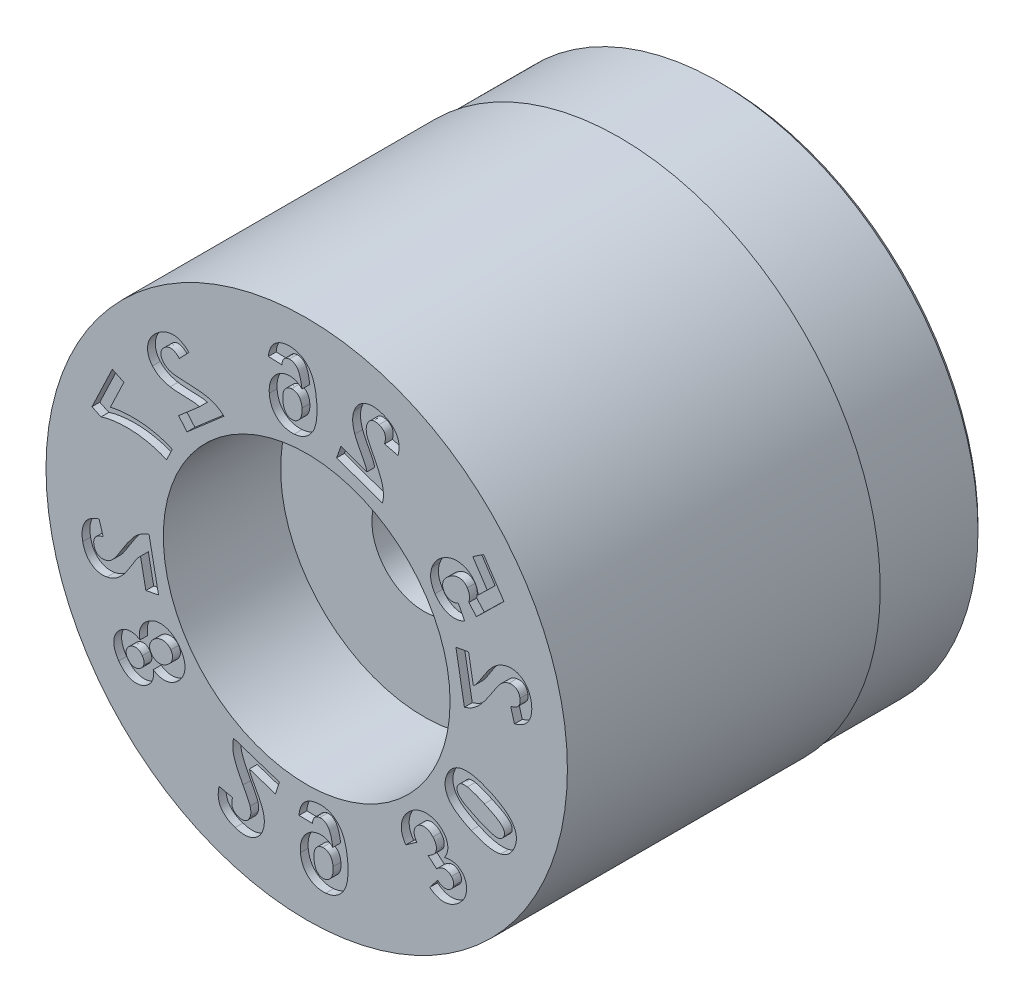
from build123d import *

# Parameters (mm, degrees)
SKETCH4_W          = 4
SKETCH4_H          = 1
CUT_EXTRUDE1_DEPTH = 0.3


with BuildPart() as part:
    # Sketch1 → Revolve1 (revolve)
    with BuildSketch(Plane(origin=(0, 0, 0), x_dir=(0, 0, -1), z_dir=(1, 0, 0)), mode=Mode.PRIVATE) as revolve1_sk:
        Polygon((0, 10), (0, 5.5), (4.5, 5.5), (4.5, 2), (16, 2), (16, 9.75), (15.75, 10), align=None)
    revolve(revolve1_sk.sketch.rotate(Axis((0, 0, 3.797909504), (0, 0, -1)), 90), axis=Axis((0, 0, 3.797909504), (0, 0, -1)))

    # Sketch4 → Cut-Revolve1 (revolve, cut)
    with BuildSketch(Plane(origin=(0, 0, 0), x_dir=(0, 0, -1), z_dir=(1, 0, 0)), mode=Mode.PRIVATE) as cut_revolve1_sk:
        with Locations((14, 10.435)):
            Rectangle(SKETCH4_W, SKETCH4_H)
    revolve(cut_revolve1_sk.sketch.rotate(Axis((0, 0, 0), (0, 0, -1)), 90), axis=Axis((0, 0, 0), (0, 0, -1)), mode=Mode.SUBTRACT)

    # Sketch6 → Cut-Extrude1 (cut)
    # profile 1 of 12: a face of its own
    with BuildSketch(Plane.XY):
        with BuildLine():
            Line((6.209333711, 2.011990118), (5.723956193, 1.925613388))
            Line((5.723956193, 1.925613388), (6.050039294, 0.094737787))
            add(Edge.make_bspline(
                [(6.050039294, 0.094737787), (6.094354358, 0.109172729), (6.183006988, 0.138049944), (6.309076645, 0.199949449), (6.428580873, 0.275807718), (6.523825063, 0.350471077), (6.598753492, 0.421020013), (6.658787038, 0.484434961), (6.722217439, 0.557553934), (6.789175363, 0.640642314), (6.859343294, 0.733755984), (6.932715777, 0.837071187), (7.009997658, 0.949976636), (7.061736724, 1.029115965), (7.08852315, 1.070088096)],
                knots=[0, 0, 0, 0, 1.148861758, 2.298306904, 3.453744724, 4.63692093, 5.27782208, 5.991693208, 6.790648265, 7.665694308, 8.624208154, 9.66704015, 10.792176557, 12, 12, 12, 12], degree=3))
            add(Edge.make_bspline(
                [(7.08852315, 1.070088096), (7.109923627, 1.102739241), (7.150757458, 1.165040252), (7.209058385, 1.253732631), (7.262725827, 1.332374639), (7.311300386, 1.401317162), (7.355004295, 1.460546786), (7.393474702, 1.51010101), (7.426277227, 1.550450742), (7.447783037, 1.572862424), (7.457338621, 1.58282051)],
                knots=[0, 0, 0, 0, 1.481704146, 2.827210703, 4.028272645, 5.095070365, 6.027981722, 6.82153751, 7.476378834, 8, 8, 8, 8], degree=3))
            add(Edge.make_bspline(
                [(7.457338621, 1.58282051), (7.480891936, 1.604035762), (7.526392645, 1.645019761), (7.601673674, 1.692798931), (7.677981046, 1.729298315), (7.731303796, 1.741683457), (7.757525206, 1.747773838)],
                knots=[0, 0, 0, 0, 1.093768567, 2.112961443, 3.072050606, 4, 4, 4, 4], degree=3))
            add(Edge.make_bspline(
                [(7.757525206, 1.747773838), (7.785289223, 1.751715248), (7.838051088, 1.75920538), (7.914782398, 1.754133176), (7.983838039, 1.736298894), (8.044001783, 1.703429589), (8.095270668, 1.658734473), (8.13608297, 1.601923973), (8.166506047, 1.534253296), (8.17723202, 1.484408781), (8.182821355, 1.458434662)],
                knots=[0, 0, 0, 0, 1.149667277, 2.184791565, 3.137708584, 4.057726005, 4.975591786, 5.909521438, 6.910645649, 8, 8, 8, 8], degree=3))
            add(Edge.make_bspline(
                [(8.182821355, 1.458434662), (8.186302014, 1.43230945), (8.193003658, 1.382008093), (8.187139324, 1.307975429), (8.166835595, 1.240117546), (8.138493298, 1.188899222), (8.108055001, 1.152404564), (8.081330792, 1.126023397), (8.049216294, 1.102604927), (8.013294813, 1.079951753), (7.971943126, 1.060525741), (7.926762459, 1.041820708), (7.876937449, 1.025264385), (7.841914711, 1.016207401), (7.823737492, 1.011506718)],
                knots=[0, 0, 0, 0, 1.461940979, 2.814814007, 4.09091683, 5.373603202, 6.034842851, 6.728053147, 7.454652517, 8.239274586, 9.085094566, 9.989706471, 10.956633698, 12, 12, 12, 12], degree=3))
            Line((7.823737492, 1.011506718), (7.968299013, 0.499820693))
            add(Edge.make_bspline(
                [(7.968299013, 0.499820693), (8.002236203, 0.510439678), (8.068142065, 0.531061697), (8.161291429, 0.569081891), (8.245761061, 0.611964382), (8.321161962, 0.66033138), (8.388169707, 0.713036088), (8.446601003, 0.770747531), (8.496379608, 0.833454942), (8.536426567, 0.901662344), (8.569047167, 0.973051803), (8.595278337, 1.04720566), (8.614613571, 1.123985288), (8.628065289, 1.203624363), (8.634241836, 1.286148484), (8.634607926, 1.371516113), (8.627722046, 1.459458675), (8.618358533, 1.51848972), (8.613594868, 1.54852162)],
                knots=[0, 0, 0, 0, 1.238472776, 2.40510829, 3.500695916, 4.534349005, 5.521042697, 6.465529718, 7.389419, 8.3019406, 9.213927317, 10.120501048, 11.038377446, 11.969130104, 12.930889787, 13.918185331, 14.940881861, 16, 16, 16, 16], degree=3))
            add(Edge.make_bspline(
                [(8.613594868, 1.54852162), (8.607314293, 1.581208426), (8.595055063, 1.64501072), (8.567335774, 1.736056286), (8.53533836, 1.82083477), (8.496781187, 1.89888514), (8.452566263, 1.970568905), (8.402007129, 2.035327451), (8.346245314, 2.094019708), (8.284279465, 2.144524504), (8.218985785, 2.188764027), (8.150936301, 2.225259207), (8.08095724, 2.254313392), (8.008633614, 2.27418987), (7.934877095, 2.288109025), (7.858725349, 2.29279494), (7.780627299, 2.289780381), (7.728370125, 2.281964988), (7.701799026, 2.277991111)],
                knots=[0, 0, 0, 0, 1.216625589, 2.374765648, 3.475837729, 4.527822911, 5.553792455, 6.550820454, 7.527782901, 8.50832879, 9.468635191, 10.408515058, 11.328074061, 12.233565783, 13.147180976, 14.068568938, 15.017929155, 16, 16, 16, 16], degree=3))
            add(Edge.make_bspline(
                [(7.701799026, 2.277991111), (7.671652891, 2.271828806), (7.611787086, 2.259591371), (7.524807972, 2.231413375), (7.441593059, 2.195031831), (7.361041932, 2.150996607), (7.283148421, 2.096643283), (7.205404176, 2.033593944), (7.127102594, 1.960850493), (7.077400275, 1.906791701), (7.05169966, 1.878838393)],
                knots=[0, 0, 0, 0, 0.948147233, 1.882881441, 2.812428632, 3.745080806, 4.708387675, 5.736522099, 6.829576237, 8, 8, 8, 8], degree=3))
            add(Edge.make_bspline(
                [(7.05169966, 1.878838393), (7.042563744, 1.868371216), (7.022947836, 1.845896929), (6.993272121, 1.80856797), (6.961710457, 1.765583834), (6.926847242, 1.717963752), (6.889830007, 1.664661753), (6.850248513, 1.605861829), (6.808158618, 1.541830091), (6.76492196, 1.474358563), (6.722414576, 1.407579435), (6.682709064, 1.345123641), (6.645597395, 1.290176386), (6.613516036, 1.240646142), (6.584972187, 1.197990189), (6.559570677, 1.162142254), (6.538264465, 1.132617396), (6.50575774, 1.089789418), (6.460217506, 1.035578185), (6.415499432, 0.994231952), (6.394212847, 0.974550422)],
                knots=[0, 0, 0, 0, 0.66944087, 1.43737003, 2.297015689, 3.239063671, 4.281255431, 5.423907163, 6.654659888, 7.973659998, 9.285471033, 10.469327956, 11.53976018, 12.480385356, 13.3130262, 14.012761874, 14.597481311, 15.067362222, 16.604013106, 18, 18, 18, 18], degree=3))
            Line((6.394212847, 0.974550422), (6.209333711, 2.011990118))
        make_face()
    # profile 2 of 12: a face of its own
    with BuildSketch(Plane.XY):
        with BuildLine():
            Line((6.06360311, 2.958657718), (5.815970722, 3.431064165))
            add(Edge.make_bspline(
                [(5.815970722, 3.431064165), (5.789388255, 3.419150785), (5.738231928, 3.396224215), (5.658155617, 3.376705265), (5.579632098, 3.372472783), (5.503949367, 3.383000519), (5.433228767, 3.405193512), (5.37080528, 3.440428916), (5.315338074, 3.484888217), (5.287518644, 3.522891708), (5.27337803, 3.542208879)],
                knots=[0, 0, 0, 0, 1.14938018, 2.211911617, 3.23635791, 4.238200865, 5.216862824, 6.146199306, 7.057713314, 8, 8, 8, 8], degree=3))
            add(Edge.make_bspline(
                [(5.27337803, 3.542208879), (5.266303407, 3.553848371), (5.252351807, 3.576802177), (5.235733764, 3.613251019), (5.22318135, 3.650707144), (5.215585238, 3.689311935), (5.212510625, 3.728804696), (5.213386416, 3.769297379), (5.21955689, 3.810677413), (5.228836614, 3.853057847), (5.244337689, 3.895382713), (5.265099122, 3.937404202), (5.290942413, 3.979307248), (5.323489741, 4.019654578), (5.361041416, 4.059577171), (5.403815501, 4.099048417), (5.452338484, 4.137890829), (5.487642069, 4.162044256), (5.505884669, 4.174525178)],
                knots=[0, 0, 0, 0, 0.863523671, 1.70292272, 2.535336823, 3.364363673, 4.191946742, 5.044401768, 5.927658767, 6.842218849, 7.792317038, 8.778598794, 9.812108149, 10.908631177, 12.060898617, 13.286992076, 14.598093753, 16, 16, 16, 16], degree=3))
            add(Edge.make_bspline(
                [(5.505884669, 4.174525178), (5.523291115, 4.185635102), (5.557066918, 4.207193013), (5.608208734, 4.235366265), (5.658451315, 4.257552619), (5.70698722, 4.275274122), (5.754414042, 4.287412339), (5.800442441, 4.294545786), (5.845209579, 4.295999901), (5.888481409, 4.292769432), (5.929924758, 4.284370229), (5.969470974, 4.272261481), (6.006928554, 4.256002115), (6.04225806, 4.2357044), (6.075738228, 4.211531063), (6.106073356, 4.182510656), (6.135341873, 4.150397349), (6.152095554, 4.126194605), (6.160701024, 4.113762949)],
                knots=[0, 0, 0, 0, 1.330812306, 2.582333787, 3.758732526, 4.867648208, 5.908821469, 6.909092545, 7.863526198, 8.789541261, 9.699420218, 10.583147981, 11.450873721, 12.325267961, 13.205043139, 14.104891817, 15.026584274, 16, 16, 16, 16], degree=3))
            add(Edge.make_bspline(
                [(6.160701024, 4.113762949), (6.170819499, 4.097826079), (6.190948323, 4.06612264), (6.212742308, 4.014248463), (6.229979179, 3.960615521), (6.240315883, 3.904495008), (6.244983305, 3.846032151), (6.242281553, 3.785542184), (6.234678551, 3.722511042), (6.224887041, 3.680389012), (6.219843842, 3.658693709)],
                knots=[0, 0, 0, 0, 0.955427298, 1.900644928, 2.842387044, 3.807171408, 4.786374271, 5.809194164, 6.871607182, 8, 8, 8, 8], degree=3))
            Line((6.219843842, 3.658693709), (6.511484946, 3.333851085))
            Line((6.511484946, 3.333851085), (7.564802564, 4.362477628))
            Line((7.564802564, 4.362477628), (6.784974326, 5.535566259))
            Line((6.784974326, 5.535566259), (6.369840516, 5.259148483))
            Line((6.369840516, 5.259148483), (6.926122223, 4.422578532))
            Line((6.926122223, 4.422578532), (6.579326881, 4.091478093))
            add(Edge.make_bspline(
                [(6.579326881, 4.091478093), (6.574399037, 4.123605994), (6.564671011, 4.187029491), (6.536929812, 4.278191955), (6.500555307, 4.364680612), (6.468022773, 4.417443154), (6.451750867, 4.44383357)],
                knots=[0, 0, 0, 0, 1.030711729, 2.034721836, 3.017020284, 4, 4, 4, 4], degree=3))
            add(Edge.make_bspline(
                [(6.451750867, 4.44383357), (6.435021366, 4.467564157), (6.402044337, 4.514341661), (6.345393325, 4.577698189), (6.283439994, 4.633196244), (6.217631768, 4.682800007), (6.145784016, 4.723000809), (6.070055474, 4.757599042), (5.988921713, 4.783656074), (5.903944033, 4.802978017), (5.8167222, 4.8140013), (5.728789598, 4.816671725), (5.641282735, 4.809283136), (5.553956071, 4.792717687), (5.467006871, 4.767820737), (5.380305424, 4.733222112), (5.293966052, 4.689753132), (5.23845919, 4.654553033), (5.210178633, 4.636618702)],
                knots=[0, 0, 0, 0, 0.991504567, 1.954444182, 2.895976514, 3.830264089, 4.76367764, 5.703105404, 6.670780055, 7.669584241, 8.676993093, 9.669978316, 10.670007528, 11.671097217, 12.7027039, 13.7553012, 14.856333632, 16, 16, 16, 16], degree=3))
            add(Edge.make_bspline(
                [(5.210178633, 4.636618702), (5.187008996, 4.620383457), (5.141231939, 4.588306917), (5.077466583, 4.534950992), (5.019236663, 4.47757822), (4.966725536, 4.415844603), (4.919368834, 4.350455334), (4.876960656, 4.281428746), (4.840234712, 4.208287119), (4.82021745, 4.157201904), (4.8101181, 4.131427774)],
                knots=[0, 0, 0, 0, 1.035313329, 2.045504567, 3.039498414, 4.024331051, 5.008783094, 5.992259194, 6.987030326, 8, 8, 8, 8], degree=3))
            add(Edge.make_bspline(
                [(4.8101181, 4.131427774), (4.798440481, 4.096063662), (4.77552919, 4.02667987), (4.756302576, 3.919869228), (4.750813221, 3.814013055), (4.757293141, 3.708779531), (4.778349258, 3.604612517), (4.812834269, 3.501644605), (4.859772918, 3.399194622), (4.900244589, 3.334242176), (4.920966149, 3.300986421)],
                knots=[0, 0, 0, 0, 1.024529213, 2.01010905, 2.977339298, 3.937418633, 4.905511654, 5.894460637, 6.921960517, 8, 8, 8, 8], degree=3))
            add(Edge.make_bspline(
                [(4.920966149, 3.300986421), (4.938967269, 3.275258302), (4.974184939, 3.22492341), (5.031462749, 3.155042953), (5.092232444, 3.092959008), (5.15612989, 3.038334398), (5.222410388, 2.989940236), (5.292450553, 2.950215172), (5.364627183, 2.916426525), (5.439915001, 2.891495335), (5.516549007, 2.873363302), (5.594029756, 2.862296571), (5.671900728, 2.859021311), (5.750174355, 2.863600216), (5.828507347, 2.876176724), (5.907127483, 2.896069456), (5.986105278, 2.92315741), (6.037501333, 2.946700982), (6.06360311, 2.958657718)],
                knots=[0, 0, 0, 0, 1.144596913, 2.23930714, 3.290159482, 4.30767143, 5.301455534, 6.277190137, 7.238966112, 8.20255223, 9.162974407, 10.107073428, 11.051738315, 11.999889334, 12.960940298, 13.93983682, 14.953734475, 16, 16, 16, 16], degree=3))
        make_face()
    # profile 3 of 12: a face of its own
    with BuildSketch(Plane.XY):
        with BuildLine():
            Line((1.312174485, 6.393603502), (1.147613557, 5.926617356))
            Line((1.147613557, 5.926617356), (2.909128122, 5.305325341))
            add(Edge.make_bspline(
                [(2.909128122, 5.305325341), (2.918287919, 5.351238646), (2.936619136, 5.443123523), (2.94564366, 5.583925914), (2.938539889, 5.725974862), (2.920825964, 5.846252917), (2.896439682, 5.946814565), (2.870131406, 6.030360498), (2.838208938, 6.122238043), (2.79812265, 6.221704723), (2.751589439, 6.329274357), (2.697864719, 6.444581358), (2.638038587, 6.568255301), (2.593938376, 6.652473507), (2.571102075, 6.696084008)],
                knots=[0, 0, 0, 0, 1.148881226, 2.299220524, 3.453877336, 4.6368823, 5.278845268, 5.993306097, 6.787166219, 7.667124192, 8.626289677, 9.665382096, 10.791070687, 12, 12, 12, 12], degree=3))
            add(Edge.make_bspline(
                [(2.571102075, 6.696084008), (2.55291005, 6.730788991), (2.518208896, 6.79698849), (2.470904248, 6.892439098), (2.428778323, 6.9784528), (2.392490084, 7.054999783), (2.361667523, 7.122309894), (2.337810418, 7.180542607), (2.318803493, 7.229334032), (2.309693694, 7.259231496), (2.305641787, 7.272529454)],
                knots=[0, 0, 0, 0, 1.480095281, 2.823270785, 4.023895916, 5.097883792, 6.023313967, 6.819749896, 7.47504189, 8, 8, 8, 8], degree=3))
            add(Edge.make_bspline(
                [(2.305641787, 7.272529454), (2.299009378, 7.303560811), (2.286174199, 7.363613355), (2.280519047, 7.452890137), (2.287797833, 7.537654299), (2.303311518, 7.590439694), (2.310971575, 7.616503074)],
                knots=[0, 0, 0, 0, 1.090694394, 2.110735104, 3.067154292, 4, 4, 4, 4], degree=3))
            add(Edge.make_bspline(
                [(2.310971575, 7.616503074), (2.321199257, 7.642560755), (2.340715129, 7.692282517), (2.382489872, 7.757221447), (2.432833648, 7.808385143), (2.491147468, 7.844962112), (2.55564382, 7.867811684), (2.62534808, 7.875034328), (2.699287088, 7.868254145), (2.747887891, 7.853048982), (2.773274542, 7.845106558)],
                knots=[0, 0, 0, 0, 1.144890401, 2.184613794, 3.139730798, 4.062726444, 4.981132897, 5.918262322, 6.912603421, 8, 8, 8, 8], degree=3))
            add(Edge.make_bspline(
                [(2.773274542, 7.845106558), (2.798020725, 7.835341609), (2.845503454, 7.816604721), (2.90714239, 7.773938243), (2.956574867, 7.722651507), (2.987399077, 7.67238207), (3.004082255, 7.627799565), (3.013862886, 7.591290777), (3.018278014, 7.551478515), (3.02022419, 7.508833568), (3.017662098, 7.462942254), (3.011097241, 7.4140831), (3.001071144, 7.362250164), (2.99177905, 7.327148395), (2.986982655, 7.309029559)],
                knots=[0, 0, 0, 0, 1.465708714, 2.812387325, 4.103745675, 5.377972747, 6.03519671, 6.729287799, 7.459772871, 8.242906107, 9.085807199, 9.994543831, 10.964823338, 12, 12, 12, 12], degree=3))
            Line((2.986982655, 7.309029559), (3.505311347, 7.183028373))
            add(Edge.make_bspline(
                [(3.505311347, 7.183028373), (3.512948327, 7.217844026), (3.527803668, 7.28556693), (3.539870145, 7.385824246), (3.5449401, 7.480961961), (3.540025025, 7.57078267), (3.527555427, 7.655623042), (3.505422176, 7.734906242), (3.475113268, 7.809293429), (3.436049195, 7.878166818), (3.38954563, 7.942073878), (3.337936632, 8.002074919), (3.28007721, 8.057168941), (3.217129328, 8.10825718), (3.147839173, 8.154384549), (3.073239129, 8.196542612), (2.993115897, 8.234817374), (2.936751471, 8.255631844), (2.908007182, 8.266246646)],
                knots=[0, 0, 0, 0, 1.235190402, 2.40267442, 3.496990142, 4.534412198, 5.516438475, 6.464454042, 7.381235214, 8.294917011, 9.202345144, 10.117887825, 11.035241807, 11.968739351, 12.925403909, 13.91760513, 14.938036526, 16, 16, 16, 16], degree=3))
            add(Edge.make_bspline(
                [(2.908007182, 8.266246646), (2.876383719, 8.276834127), (2.814612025, 8.297515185), (2.721446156, 8.318831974), (2.631285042, 8.332972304), (2.543903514, 8.337757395), (2.459493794, 8.333879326), (2.377760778, 8.322850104), (2.298967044, 8.302414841), (2.223934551, 8.273368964), (2.153011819, 8.238307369), (2.087478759, 8.196698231), (2.027706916, 8.149836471), (1.974110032, 8.096860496), (1.926244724, 8.038390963), (1.883875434, 7.974467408), (1.847806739, 7.904558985), (1.828891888, 7.85509231), (1.819254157, 7.829887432)],
                knots=[0, 0, 0, 0, 1.21342522, 2.370244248, 3.47459029, 4.532505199, 5.549970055, 6.546826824, 7.529712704, 8.505692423, 9.471220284, 10.405385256, 11.326766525, 12.231018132, 13.143125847, 14.073040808, 15.018151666, 16, 16, 16, 16], degree=3))
            add(Edge.make_bspline(
                [(1.819254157, 7.829887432), (1.809536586, 7.800379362), (1.790315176, 7.742012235), (1.77280113, 7.651657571), (1.762445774, 7.561002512), (1.761982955, 7.468698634), (1.770436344, 7.373932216), (1.786587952, 7.274848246), (1.811815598, 7.170658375), (1.834333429, 7.100449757), (1.845976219, 7.064148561)],
                knots=[0, 0, 0, 0, 0.952845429, 1.884733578, 2.819304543, 3.75064459, 4.712728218, 5.737052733, 6.829948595, 8, 8, 8, 8], degree=3))
            add(Edge.make_bspline(
                [(1.845976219, 7.064148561), (1.850558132, 7.050901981), (1.860365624, 7.022547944), (1.879108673, 6.978635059), (1.900138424, 6.929416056), (1.925163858, 6.87565662), (1.953347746, 6.816825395), (1.984916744, 6.753005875), (2.019982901, 6.68453481), (2.057617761, 6.613399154), (2.095223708, 6.543472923), (2.129153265, 6.477491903), (2.159799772, 6.418326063), (2.18674974, 6.365557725), (2.209496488, 6.319128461), (2.228579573, 6.279306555), (2.243729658, 6.246047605), (2.265359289, 6.196629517), (2.290144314, 6.129933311), (2.30359351, 6.070156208), (2.309984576, 6.041750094)],
                knots=[0, 0, 0, 0, 0.672336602, 1.439122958, 2.289796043, 3.240623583, 4.283909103, 5.419849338, 6.656788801, 7.974896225, 9.281228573, 10.466266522, 11.534704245, 12.47835274, 13.309163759, 14.01535982, 14.597084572, 15.062533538, 16.604114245, 18, 18, 18, 18], degree=3))
            Line((2.309984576, 6.041750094), (1.312174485, 6.393603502))
        make_face()
    # profile 4 of 12: a face of its own
    with BuildSketch(Plane.XY):
        with BuildLine():
            Line((-1.470062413, 7.987297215), (-0.951147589, 7.967533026))
            add(Edge.make_bspline(
                [(-0.951147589, 7.967533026), (-0.949204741, 7.992748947), (-0.945539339, 8.040321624), (-0.929324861, 8.106684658), (-0.904642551, 8.163463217), (-0.870645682, 8.209939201), (-0.829735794, 8.247226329), (-0.78158541, 8.274576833), (-0.726951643, 8.292716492), (-0.68812197, 8.297195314), (-0.668020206, 8.299513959)],
                knots=[0, 0, 0, 0, 1.247790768, 2.354097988, 3.358635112, 4.286162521, 5.17767017, 6.072997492, 7.00240858, 8, 8, 8, 8], degree=3))
            add(Edge.make_bspline(
                [(-0.668020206, 8.299513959), (-0.654262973, 8.300148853), (-0.626987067, 8.301407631), (-0.586578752, 8.296594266), (-0.547421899, 8.287327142), (-0.509532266, 8.273211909), (-0.472590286, 8.254653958), (-0.437421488, 8.230460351), (-0.403848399, 8.201359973), (-0.370452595, 8.167751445), (-0.339083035, 8.125722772), (-0.310616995, 8.073641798), (-0.283830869, 8.011642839), (-0.259860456, 7.938963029), (-0.236908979, 7.856402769), (-0.215765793, 7.76318348), (-0.197514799, 7.659540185), (-0.186826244, 7.586816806), (-0.18125251, 7.548893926)],
                knots=[0, 0, 0, 0, 0.665977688, 1.32040683, 1.96269713, 2.61089557, 3.274035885, 3.959845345, 4.671928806, 5.42350092, 6.250185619, 7.201891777, 8.291437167, 9.516765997, 10.904901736, 12.440341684, 14.14375381, 16, 16, 16, 16], degree=3))
            add(Edge.make_bspline(
                [(-0.18125251, 7.548893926), (-0.199187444, 7.56632944), (-0.234482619, 7.600641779), (-0.292539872, 7.644530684), (-0.353063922, 7.680975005), (-0.415622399, 7.710549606), (-0.481221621, 7.731346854), (-0.549034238, 7.745045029), (-0.619689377, 7.751118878), (-0.667394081, 7.74926317), (-0.691696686, 7.748317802)],
                knots=[0, 0, 0, 0, 1.058420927, 2.082926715, 3.07336863, 4.046186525, 5.005769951, 5.97984349, 6.970854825, 8, 8, 8, 8], degree=3))
            add(Edge.make_bspline(
                [(-0.691696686, 7.748317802), (-0.718882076, 7.745584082), (-0.772581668, 7.740184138), (-0.851017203, 7.72258279), (-0.925939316, 7.697351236), (-0.99702282, 7.663651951), (-1.064620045, 7.622669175), (-1.12900334, 7.57440736), (-1.189038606, 7.517656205), (-1.24547161, 7.454496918), (-1.296486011, 7.38549234), (-1.340365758, 7.311459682), (-1.375343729, 7.232965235), (-1.404206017, 7.150974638), (-1.422925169, 7.064287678), (-1.436199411, 6.973827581), (-1.439964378, 6.879054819), (-1.43693772, 6.814813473), (-1.435397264, 6.782117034)],
                knots=[0, 0, 0, 0, 0.963062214, 1.902347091, 2.828458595, 3.74631477, 4.671157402, 5.612777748, 6.578793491, 7.580267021, 8.596912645, 9.601118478, 10.609193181, 11.623804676, 12.661222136, 13.731978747, 14.845662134, 16, 16, 16, 16], degree=3))
            add(Edge.make_bspline(
                [(-1.435397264, 6.782117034), (-1.432239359, 6.747444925), (-1.426074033, 6.67975294), (-1.4065579, 6.581701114), (-1.380925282, 6.489301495), (-1.346832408, 6.402955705), (-1.305969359, 6.322080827), (-1.257297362, 6.247017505), (-1.200563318, 6.178241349), (-1.137441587, 6.115393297), (-1.068795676, 6.059839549), (-0.99562682, 6.012210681), (-0.918448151, 5.973524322), (-0.837710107, 5.941667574), (-0.752536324, 5.920289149), (-0.663782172, 5.905890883), (-0.571096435, 5.900261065), (-0.508243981, 5.903297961), (-0.476282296, 5.904842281)],
                knots=[0, 0, 0, 0, 1.142575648, 2.230704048, 3.277876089, 4.287551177, 5.273883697, 6.249012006, 7.218790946, 8.196235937, 9.169332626, 10.113667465, 11.057263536, 12.000080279, 12.957871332, 13.934699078, 14.949754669, 16, 16, 16, 16], degree=3))
            add(Edge.make_bspline(
                [(-0.476282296, 5.904842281), (-0.441979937, 5.908084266), (-0.374739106, 5.914439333), (-0.277566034, 5.938446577), (-0.184990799, 5.969468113), (-0.098466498, 6.01235158), (-0.016880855, 6.0643898), (0.058417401, 6.127042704), (0.129000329, 6.198980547), (0.194073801, 6.280673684), (0.251918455, 6.37413783), (0.299553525, 6.48029403), (0.337630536, 6.598660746), (0.365836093, 6.729369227), (0.384799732, 6.872331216), (0.394823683, 7.027621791), (0.395269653, 7.195162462), (0.388590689, 7.310631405), (0.38513086, 7.370446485)],
                knots=[0, 0, 0, 0, 0.860021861, 1.685848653, 2.49507509, 3.296015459, 4.092691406, 4.908542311, 5.738496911, 6.607824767, 7.513661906, 8.478109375, 9.508413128, 10.615936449, 11.815605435, 13.109677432, 14.50275864, 16, 16, 16, 16], degree=3))
            add(Edge.make_bspline(
                [(0.38513086, 7.370446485), (0.379911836, 7.431811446), (0.369843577, 7.550193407), (0.344667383, 7.720488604), (0.311447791, 7.876839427), (0.270565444, 8.019363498), (0.222246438, 8.148103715), (0.165099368, 8.26262021), (0.100653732, 8.363675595), (0.027643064, 8.450678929), (-0.052033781, 8.524247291), (-0.135283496, 8.588141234), (-0.224020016, 8.6398556), (-0.316692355, 8.681570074), (-0.414370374, 8.711387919), (-0.51617679, 8.731206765), (-0.622902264, 8.73950892), (-0.695202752, 8.736239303), (-0.732087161, 8.734571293)],
                knots=[0, 0, 0, 0, 1.480492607, 2.856086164, 4.135915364, 5.320921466, 6.417997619, 7.437243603, 8.392641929, 9.29323059, 10.159566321, 10.99556063, 11.811344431, 12.623304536, 13.433682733, 14.261063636, 15.112874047, 16, 16, 16, 16], degree=3))
            add(Edge.make_bspline(
                [(-0.732087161, 8.734571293), (-0.757821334, 8.732316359), (-0.808366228, 8.727887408), (-0.881779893, 8.713732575), (-0.951471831, 8.69486378), (-1.017561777, 8.67088986), (-1.079669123, 8.641025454), (-1.13798992, 8.605916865), (-1.192522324, 8.565887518), (-1.242975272, 8.520543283), (-1.289223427, 8.47025241), (-1.330774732, 8.415183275), (-1.366467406, 8.355049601), (-1.397987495, 8.290941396), (-1.423646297, 8.221612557), (-1.445023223, 8.147904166), (-1.460465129, 8.069189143), (-1.466809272, 8.015055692), (-1.470062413, 7.987297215)],
                knots=[0, 0, 0, 0, 1.071252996, 2.104064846, 3.097069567, 4.064752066, 5.016696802, 5.951802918, 6.88545988, 7.819245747, 8.761883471, 9.716353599, 10.675917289, 11.659208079, 12.67643197, 13.738998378, 14.840606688, 16, 16, 16, 16], degree=3))
        make_face()
        with BuildLine():
            add(Edge.make_bspline(
                [(-0.181040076, 6.913279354), (-0.179781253, 6.892263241), (-0.177330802, 6.851352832), (-0.179560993, 6.791558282), (-0.184022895, 6.735034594), (-0.193697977, 6.682005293), (-0.206833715, 6.632419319), (-0.224325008, 6.586217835), (-0.246074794, 6.543651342), (-0.270940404, 6.504343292), (-0.298866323, 6.469329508), (-0.328458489, 6.438425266), (-0.359346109, 6.411752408), (-0.391456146, 6.389396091), (-0.425102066, 6.371551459), (-0.459823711, 6.357266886), (-0.49648276, 6.348032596), (-0.521498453, 6.34547337), (-0.534158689, 6.344178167)],
                knots=[0, 0, 0, 0, 1.355433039, 2.638514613, 3.850910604, 5.004949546, 6.105653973, 7.151484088, 8.180605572, 9.179978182, 10.142680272, 11.060645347, 11.932660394, 12.767536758, 13.575302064, 14.381539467, 15.180910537, 16, 16, 16, 16], degree=3))
            add(Edge.make_bspline(
                [(-0.534158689, 6.344178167), (-0.558151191, 6.343846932), (-0.60485546, 6.343202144), (-0.673136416, 6.360769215), (-0.735157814, 6.393974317), (-0.782175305, 6.43253292), (-0.814994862, 6.471566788), (-0.837645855, 6.506182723), (-0.857192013, 6.545892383), (-0.875008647, 6.589860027), (-0.888245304, 6.639322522), (-0.899961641, 6.693047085), (-0.908808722, 6.751778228), (-0.912325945, 6.792600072), (-0.914141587, 6.813672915)],
                knots=[0, 0, 0, 0, 1.263292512, 2.459149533, 3.676190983, 4.955787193, 5.643620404, 6.363807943, 7.135266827, 7.978497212, 8.8654785, 9.83586205, 10.882839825, 12, 12, 12, 12], degree=3))
            add(Edge.make_bspline(
                [(-0.914141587, 6.813672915), (-0.915381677, 6.835425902), (-0.917783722, 6.877561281), (-0.917576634, 6.938954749), (-0.913279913, 6.996144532), (-0.90559731, 7.048980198), (-0.894447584, 7.097554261), (-0.879206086, 7.14165632), (-0.860475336, 7.181796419), (-0.837583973, 7.21711484), (-0.812429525, 7.248743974), (-0.785056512, 7.276561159), (-0.755737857, 7.300753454), (-0.724047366, 7.320369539), (-0.691209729, 7.337427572), (-0.655957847, 7.349687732), (-0.618680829, 7.357694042), (-0.593172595, 7.360496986), (-0.580156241, 7.361927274)],
                knots=[0, 0, 0, 0, 1.444706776, 2.798386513, 4.067911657, 5.244813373, 6.336184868, 7.367593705, 8.333900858, 9.265871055, 10.151752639, 11.009778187, 11.849696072, 12.66547333, 13.477094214, 14.298973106, 15.131999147, 16, 16, 16, 16], degree=3))
            add(Edge.make_bspline(
                [(-0.580156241, 7.361927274), (-0.555398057, 7.362479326), (-0.506647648, 7.36356635), (-0.435638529, 7.344180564), (-0.369359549, 7.310907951), (-0.320139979, 7.27015509), (-0.284872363, 7.2306898), (-0.260507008, 7.196813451), (-0.239296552, 7.15899798), (-0.221618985, 7.116990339), (-0.206788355, 7.071527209), (-0.194580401, 7.022336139), (-0.186097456, 6.969182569), (-0.182759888, 6.932289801), (-0.181040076, 6.913279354)],
                knots=[0, 0, 0, 0, 1.315670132, 2.590636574, 3.880626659, 5.25064959, 5.970220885, 6.702208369, 7.473087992, 8.279138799, 9.130605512, 10.023235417, 10.981394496, 12, 12, 12, 12], degree=3))
        make_face(mode=Mode.SUBTRACT)
    # profile 5 of 12: a face of its own
    with BuildSketch(Plane.XY):
        with BuildLine():
            Line((-4.915118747, 4.297664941), (-4.589668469, 3.922537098))
            Line((-4.589668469, 3.922537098), (-3.175066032, 5.150491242))
            add(Edge.make_bspline(
                [(-3.175066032, 5.150491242), (-3.210550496, 5.181244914), (-3.281525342, 5.242757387), (-3.400132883, 5.319940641), (-3.527160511, 5.38488813), (-3.640992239, 5.428459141), (-3.740713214, 5.456781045), (-3.826431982, 5.476260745), (-3.922520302, 5.493164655), (-4.028938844, 5.507497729), (-4.14559137, 5.520077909), (-4.272711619, 5.530903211), (-4.410180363, 5.539042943), (-4.505291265, 5.542816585), (-4.554478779, 5.54476816)],
                knots=[0, 0, 0, 0, 1.149459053, 2.299109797, 3.456646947, 4.640252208, 5.278410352, 5.995541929, 6.793130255, 7.668135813, 8.626126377, 9.667744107, 10.793851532, 12, 12, 12, 12], degree=3))
            add(Edge.make_bspline(
                [(-4.554478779, 5.54476816), (-4.593750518, 5.546065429), (-4.66866951, 5.548540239), (-4.77554179, 5.554540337), (-4.87141865, 5.560068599), (-4.956273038, 5.566347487), (-5.030043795, 5.573677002), (-5.093110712, 5.580434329), (-5.145050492, 5.588856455), (-5.175757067, 5.595651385), (-5.189298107, 5.598647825)],
                knots=[0, 0, 0, 0, 1.47842347, 2.820399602, 4.027397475, 5.091998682, 6.02156815, 6.816795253, 7.47822826, 8, 8, 8, 8], degree=3))
            add(Edge.make_bspline(
                [(-5.189298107, 5.598647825), (-5.219744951, 5.607895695), (-5.278534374, 5.625752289), (-5.358356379, 5.666534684), (-5.429200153, 5.713699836), (-5.467423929, 5.753526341), (-5.486198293, 5.773087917)],
                knots=[0, 0, 0, 0, 1.091599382, 2.107755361, 3.070586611, 4, 4, 4, 4], degree=3))
            add(Edge.make_bspline(
                [(-5.486198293, 5.773087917), (-5.504015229, 5.795145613), (-5.537709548, 5.836859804), (-5.573202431, 5.905812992), (-5.59362408, 5.974779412), (-5.596193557, 6.044020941), (-5.583625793, 6.111264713), (-5.55620588, 6.175980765), (-5.513172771, 6.236988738), (-5.475891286, 6.272261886), (-5.456436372, 6.290668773)],
                knots=[0, 0, 0, 0, 1.153873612, 2.182136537, 3.141415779, 4.064208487, 4.980043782, 5.910367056, 6.909549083, 8, 8, 8, 8], degree=3))
            add(Edge.make_bspline(
                [(-5.456436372, 6.290668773), (-5.43565821, 6.307100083), (-5.395645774, 6.338741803), (-5.328578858, 6.372277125), (-5.25912189, 6.389473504), (-5.200163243, 6.391229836), (-5.152726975, 6.384699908), (-5.116275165, 6.373991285), (-5.078988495, 6.359131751), (-5.041442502, 6.338388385), (-5.00265599, 6.313747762), (-4.963058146, 6.284156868), (-4.923270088, 6.24928025), (-4.897219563, 6.223754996), (-4.883727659, 6.210535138)],
                knots=[0, 0, 0, 0, 1.457165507, 2.806058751, 4.09560633, 5.371082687, 6.030487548, 6.727002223, 7.45918222, 8.238215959, 9.086651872, 9.990343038, 10.959172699, 12, 12, 12, 12], degree=3))
            Line((-4.883727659, 6.210535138), (-4.516450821, 6.599999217))
            add(Edge.make_bspline(
                [(-4.516450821, 6.599999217), (-4.543127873, 6.623952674), (-4.594842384, 6.670387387), (-4.676269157, 6.730691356), (-4.756814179, 6.78186889), (-4.83733981, 6.82254732), (-4.917693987, 6.853027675), (-4.997580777, 6.873814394), (-5.077590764, 6.884240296), (-5.157053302, 6.883969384), (-5.235706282, 6.874871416), (-5.313446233, 6.859472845), (-5.390147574, 6.836610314), (-5.466029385, 6.80727438), (-5.540521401, 6.770003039), (-5.613840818, 6.725658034), (-5.686752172, 6.67484416), (-5.733019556, 6.636098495), (-5.75666349, 6.61629837)],
                knots=[0, 0, 0, 0, 1.239399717, 2.402624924, 3.499735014, 4.536471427, 5.516993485, 6.466733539, 7.385047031, 8.299527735, 9.207607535, 10.119753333, 11.037018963, 11.972229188, 12.930035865, 13.913687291, 14.933835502, 16, 16, 16, 16], degree=3))
            add(Edge.make_bspline(
                [(-5.75666349, 6.61629837), (-5.781672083, 6.593989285), (-5.830379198, 6.550539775), (-5.894817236, 6.479675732), (-5.951465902, 6.407921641), (-5.999054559, 6.334078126), (-6.037629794, 6.258689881), (-6.068618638, 6.182039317), (-6.089065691, 6.103129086), (-6.101877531, 6.023312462), (-6.105486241, 5.944010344), (-6.102755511, 5.86624377), (-6.091368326, 5.790897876), (-6.071886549, 5.717814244), (-6.045480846, 5.646740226), (-6.009473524, 5.578798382), (-5.967903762, 5.511912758), (-5.93378942, 5.471135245), (-5.91645545, 5.450415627)],
                knots=[0, 0, 0, 0, 1.2160106, 2.36832065, 3.472144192, 4.532250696, 5.551945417, 6.543110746, 7.527394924, 8.504985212, 9.472935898, 10.404919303, 11.326236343, 12.232729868, 13.14721964, 14.07205598, 15.020384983, 16, 16, 16, 16], degree=3))
            add(Edge.make_bspline(
                [(-5.91645545, 5.450415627), (-5.895567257, 5.427464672), (-5.853998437, 5.381790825), (-5.784089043, 5.321665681), (-5.709394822, 5.26876465), (-5.629514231, 5.222515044), (-5.543029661, 5.182016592), (-5.44803312, 5.148066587), (-5.344912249, 5.117747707), (-5.272513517, 5.102540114), (-5.235241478, 5.094710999)],
                knots=[0, 0, 0, 0, 0.949441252, 1.889447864, 2.816236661, 3.748489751, 4.711858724, 5.735776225, 6.834340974, 8, 8, 8, 8], degree=3))
            add(Edge.make_bspline(
                [(-5.235241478, 5.094710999), (-5.221431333, 5.092236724), (-5.191790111, 5.086926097), (-5.144063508, 5.081108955), (-5.090531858, 5.074912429), (-5.031165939, 5.070167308), (-4.966117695, 5.065208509), (-4.895077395, 5.061425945), (-4.818093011, 5.058450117), (-4.737465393, 5.055872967), (-4.657753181, 5.053132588), (-4.583295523, 5.051400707), (-4.516439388, 5.048412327), (-4.457153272, 5.045715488), (-4.405430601, 5.042883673), (-4.361270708, 5.039988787), (-4.324661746, 5.037122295), (-4.270853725, 5.031669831), (-4.200621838, 5.019120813), (-4.141727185, 5.001681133), (-4.113698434, 4.993381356)],
                knots=[0, 0, 0, 0, 0.671039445, 1.440276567, 2.29932097, 3.248903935, 4.288873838, 5.420105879, 6.65181696, 7.974351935, 9.279105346, 10.467313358, 11.53704873, 12.480419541, 13.306373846, 14.014985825, 14.597446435, 15.062878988, 16.602184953, 18, 18, 18, 18], degree=3))
            Line((-4.113698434, 4.993381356), (-4.915118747, 4.297664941))
        make_face()
    # profile 6 of 12: a face of its own
    with BuildSketch(Plane.XY):
        with BuildLine():
            Line((-7.012268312, 4.357418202), (-7.456247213, 4.569352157))
            Line((-7.456247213, 4.569352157), (-8.236639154, 2.934204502))
            Line((-8.236639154, 2.934204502), (-7.889810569, 2.768584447))
            add(Edge.make_bspline(
                [(-7.889810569, 2.768584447), (-7.864384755, 2.777439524), (-7.812057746, 2.795663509), (-7.729433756, 2.81815594), (-7.641672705, 2.839763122), (-7.548127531, 2.857688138), (-7.449434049, 2.873870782), (-7.345112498, 2.887792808), (-7.23523496, 2.899598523), (-7.081348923, 2.911024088), (-6.885105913, 2.918599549), (-6.648438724, 2.910822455), (-6.411861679, 2.888268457), (-6.216267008, 2.857171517), (-6.062265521, 2.825988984), (-5.951216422, 2.799401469), (-5.844332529, 2.771949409), (-5.741961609, 2.741714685), (-5.644048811, 2.709415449), (-5.550346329, 2.67494914), (-5.461146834, 2.6386231), (-5.403913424, 2.611909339), (-5.37587611, 2.59882289)],
                knots=[0, 0, 0, 0, 0.627555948, 1.291527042, 1.995464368, 2.734484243, 3.511459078, 4.327092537, 5.188017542, 6.087626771, 7.92458703, 9.763857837, 11.604182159, 13.462094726, 14.378560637, 15.267085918, 16.124117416, 16.951214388, 17.755303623, 18.527568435, 19.278690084, 20, 20, 20, 20], degree=3))
            Line((-5.37587611, 2.59882289), (-5.155772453, 3.059477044))
            add(Edge.make_bspline(
                [(-5.155772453, 3.059477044), (-5.199715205, 3.078644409), (-5.288018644, 3.117161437), (-5.42450538, 3.166499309), (-5.56384998, 3.211966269), (-5.707110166, 3.250201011), (-5.853358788, 3.28488275), (-6.003581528, 3.311968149), (-6.156929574, 3.334695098), (-6.31302342, 3.35087089), (-6.469954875, 3.361095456), (-6.62615893, 3.366758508), (-6.780774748, 3.365086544), (-6.933886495, 3.357984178), (-7.085494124, 3.345127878), (-7.235698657, 3.326725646), (-7.38414231, 3.301423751), (-7.482047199, 3.280336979), (-7.530933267, 3.269807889)],
                knots=[0, 0, 0, 0, 0.949022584, 1.907071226, 2.872245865, 3.85045275, 4.842052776, 5.847508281, 6.871788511, 7.911025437, 8.953718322, 9.985278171, 11.005160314, 12.01439799, 13.019608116, 14.01712659, 15.009907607, 16, 16, 16, 16], degree=3))
            Line((-7.530933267, 3.269807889), (-7.012268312, 4.357418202))
        make_face()
    # profile 7 of 12: a face of its own
    with BuildSketch(Plane.XY):
        with BuildLine():
            Line((-6.169177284, -2.138726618), (-5.683849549, -2.042451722))
            Line((-5.683849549, -2.042451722), (-6.0473338, -0.211801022))
            add(Edge.make_bspline(
                [(-6.0473338, -0.211801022), (-6.09143395, -0.226996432), (-6.179747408, -0.257426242), (-6.304317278, -0.322868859), (-6.423675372, -0.399984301), (-6.517606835, -0.477164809), (-6.591293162, -0.54974003), (-6.650030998, -0.614715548), (-6.712671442, -0.689012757), (-6.777450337, -0.774297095), (-6.84623915, -0.868869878), (-6.918258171, -0.973777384), (-6.99362537, -1.088543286), (-7.043718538, -1.169231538), (-7.069604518, -1.210927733)],
                knots=[0, 0, 0, 0, 1.145547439, 2.294034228, 3.449164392, 4.635966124, 5.27542791, 5.991191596, 6.789055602, 7.664410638, 8.624030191, 9.664640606, 10.793187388, 12, 12, 12, 12], degree=3))
            add(Edge.make_bspline(
                [(-7.069604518, -1.210927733), (-7.090313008, -1.244298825), (-7.12964551, -1.307681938), (-7.187069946, -1.39736362), (-7.23930693, -1.477215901), (-7.286556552, -1.547642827), (-7.329753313, -1.607572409), (-7.366537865, -1.658810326), (-7.399576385, -1.699344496), (-7.420678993, -1.72243933), (-7.430044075, -1.732688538)],
                knots=[0, 0, 0, 0, 1.484547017, 2.819662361, 4.025185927, 5.091500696, 6.024915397, 6.817584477, 7.475258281, 8, 8, 8, 8], degree=3))
            add(Edge.make_bspline(
                [(-7.430044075, -1.732688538), (-7.453203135, -1.754293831), (-7.49802643, -1.796109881), (-7.571972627, -1.846428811), (-7.648414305, -1.883394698), (-7.701630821, -1.896915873), (-7.727760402, -1.903554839)],
                knots=[0, 0, 0, 0, 1.090638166, 2.11088003, 3.072432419, 4, 4, 4, 4], degree=3))
            add(Edge.make_bspline(
                [(-7.727760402, -1.903554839), (-7.755586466, -1.908046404), (-7.808323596, -1.916559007), (-7.885471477, -1.913120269), (-7.955317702, -1.897075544), (-8.016604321, -1.865503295), (-8.068239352, -1.821053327), (-8.110522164, -1.765397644), (-8.141725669, -1.697764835), (-8.153910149, -1.648090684), (-8.160289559, -1.622082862)],
                knots=[0, 0, 0, 0, 1.151492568, 2.182357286, 3.140870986, 4.064225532, 4.97492641, 5.908914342, 6.905173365, 8, 8, 8, 8], degree=3))
            add(Edge.make_bspline(
                [(-8.160289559, -1.622082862), (-8.164225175, -1.595884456), (-8.171781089, -1.545586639), (-8.167844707, -1.471032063), (-8.147925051, -1.402855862), (-8.121307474, -1.350478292), (-8.09150949, -1.313194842), (-8.06432877, -1.286962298), (-8.033347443, -1.261560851), (-7.997122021, -1.239163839), (-7.95657584, -1.218013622), (-7.911517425, -1.198946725), (-7.861822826, -1.181360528), (-7.82692194, -1.171632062), (-7.808798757, -1.166580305)],
                knots=[0, 0, 0, 0, 1.464945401, 2.812520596, 4.094869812, 5.374205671, 6.036963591, 6.729156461, 7.463073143, 8.251227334, 9.08273859, 9.993978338, 10.958321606, 12, 12, 12, 12], degree=3))
            Line((-7.808798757, -1.166580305), (-7.964144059, -0.655962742))
            add(Edge.make_bspline(
                [(-7.964144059, -0.655962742), (-7.998151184, -0.667136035), (-8.063984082, -0.688765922), (-8.155983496, -0.730237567), (-8.240292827, -0.77377589), (-8.314693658, -0.824007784), (-8.381361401, -0.877752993), (-8.437894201, -0.937739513), (-8.487532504, -1.000979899), (-8.526131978, -1.070187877), (-8.557606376, -1.142387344), (-8.582541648, -1.217392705), (-8.601050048, -1.295005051), (-8.61182182, -1.375476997), (-8.617218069, -1.458270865), (-8.614880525, -1.543858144), (-8.607284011, -1.632020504), (-8.59648443, -1.691163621), (-8.590998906, -1.721204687)],
                knots=[0, 0, 0, 0, 1.241591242, 2.403541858, 3.498748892, 4.530941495, 5.514322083, 6.464507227, 7.386185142, 8.297454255, 9.206247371, 10.117123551, 11.037521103, 11.971342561, 12.932040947, 13.914243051, 14.940563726, 16, 16, 16, 16], degree=3))
            add(Edge.make_bspline(
                [(-8.590998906, -1.721204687), (-8.583974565, -1.753827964), (-8.570272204, -1.817466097), (-8.540553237, -1.908204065), (-8.506719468, -1.992655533), (-8.466504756, -2.070298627), (-8.421014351, -2.141522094), (-8.36873488, -2.205165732), (-8.311378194, -2.262438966), (-8.248873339, -2.312539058), (-8.182436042, -2.355377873), (-8.113645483, -2.391062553), (-8.042402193, -2.418047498), (-7.969771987, -2.438204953), (-7.895016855, -2.449266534), (-7.818700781, -2.452885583), (-7.740264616, -2.448637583), (-7.688034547, -2.439805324), (-7.661415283, -2.435303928)],
                knots=[0, 0, 0, 0, 1.215575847, 2.371220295, 3.475237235, 4.528447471, 5.553682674, 6.549761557, 7.524276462, 8.50326077, 9.463541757, 10.401559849, 11.322262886, 12.235546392, 13.143653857, 14.070390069, 15.016566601, 16, 16, 16, 16], degree=3))
            add(Edge.make_bspline(
                [(-7.661415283, -2.435303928), (-7.631130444, -2.428490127), (-7.571226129, -2.415012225), (-7.484738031, -2.384044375), (-7.402025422, -2.346299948), (-7.32237076, -2.300158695), (-7.244739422, -2.245238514), (-7.16826463, -2.179839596), (-7.090790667, -2.105649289), (-7.042034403, -2.050186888), (-7.016899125, -2.021594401)],
                knots=[0, 0, 0, 0, 0.952786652, 1.884640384, 2.815697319, 3.742510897, 4.708090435, 5.732530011, 6.831053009, 8, 8, 8, 8], degree=3))
            add(Edge.make_bspline(
                [(-7.016899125, -2.021594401), (-7.007919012, -2.010893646), (-6.98865093, -1.987933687), (-6.95991153, -1.949758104), (-6.928666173, -1.906259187), (-6.894870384, -1.857736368), (-6.858731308, -1.803725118), (-6.820588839, -1.744021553), (-6.77928974, -1.679223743), (-6.737886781, -1.61019795), (-6.69645912, -1.542337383), (-6.657443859, -1.479218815), (-6.622004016, -1.422632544), (-6.590313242, -1.372461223), (-6.561866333, -1.329222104), (-6.537946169, -1.292187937), (-6.516846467, -1.262376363), (-6.485363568, -1.218566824), (-6.440148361, -1.163728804), (-6.395900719, -1.121387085), (-6.374868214, -1.101260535)],
                knots=[0, 0, 0, 0, 0.670537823, 1.438732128, 2.29312051, 3.241743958, 4.277336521, 5.412679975, 6.64287189, 7.965985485, 9.276557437, 10.459781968, 11.528227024, 12.48193242, 13.30847493, 14.012994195, 14.598136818, 15.061493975, 16.603221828, 18, 18, 18, 18], degree=3))
            Line((-6.374868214, -1.101260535), (-6.169177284, -2.138726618))
        make_face()
    # profile 8 of 12: a face of its own
    with BuildSketch(Plane.XY):
        with BuildLine():
            add(Edge.make_bspline(
                [(-6.39605522, -3.894466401), (-6.411655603, -3.885032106), (-6.44239998, -3.866439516), (-6.489373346, -3.842276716), (-6.536213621, -3.822498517), (-6.582563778, -3.806199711), (-6.628798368, -3.794205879), (-6.674832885, -3.786870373), (-6.720343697, -3.782841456), (-6.780113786, -3.783900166), (-6.853335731, -3.792938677), (-6.938027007, -3.815990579), (-7.019614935, -3.849755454), (-7.069148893, -3.881834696), (-7.094217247, -3.898069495)],
                knots=[0, 0, 0, 0, 0.881929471, 1.738058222, 2.553004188, 3.340216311, 4.113426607, 4.860312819, 5.593431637, 6.32083557, 7.749105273, 9.149808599, 10.557563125, 12, 12, 12, 12], degree=3))
            add(Edge.make_bspline(
                [(-7.094217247, -3.898069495), (-7.114861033, -3.913021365), (-7.155363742, -3.942356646), (-7.209366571, -3.992929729), (-7.257368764, -4.046409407), (-7.29805052, -4.104214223), (-7.332230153, -4.165287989), (-7.360160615, -4.229937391), (-7.380577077, -4.298542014), (-7.394891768, -4.370257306), (-7.401932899, -4.444601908), (-7.39918861, -4.520454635), (-7.388825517, -4.597311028), (-7.369309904, -4.674982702), (-7.34135178, -4.753577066), (-7.305814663, -4.833748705), (-7.26072563, -4.914445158), (-7.225848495, -4.96718931), (-7.207942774, -4.994267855)],
                knots=[0, 0, 0, 0, 0.983736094, 1.930071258, 2.851468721, 3.755378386, 4.654224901, 5.550805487, 6.469822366, 7.413729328, 8.372086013, 9.347088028, 10.339060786, 11.362681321, 12.434393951, 13.557925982, 14.746253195, 16, 16, 16, 16], degree=3))
            add(Edge.make_bspline(
                [(-7.207942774, -4.994267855), (-7.189309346, -5.020495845), (-7.153025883, -5.071567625), (-7.092470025, -5.140388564), (-7.031271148, -5.202471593), (-6.966626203, -5.255057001), (-6.90075653, -5.300491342), (-6.832640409, -5.337404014), (-6.762434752, -5.366079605), (-6.690477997, -5.38637525), (-6.618022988, -5.398105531), (-6.546376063, -5.40375961), (-6.475905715, -5.400034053), (-6.406251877, -5.390163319), (-6.337910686, -5.371834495), (-6.270880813, -5.34586564), (-6.204851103, -5.31287109), (-6.162995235, -5.285565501), (-6.141651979, -5.271641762)],
                knots=[0, 0, 0, 0, 1.243385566, 2.421150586, 3.540750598, 4.610857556, 5.638497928, 6.631389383, 7.600701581, 8.565635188, 9.515717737, 10.435435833, 11.339271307, 12.238903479, 13.151717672, 14.068617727, 15.015144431, 16, 16, 16, 16], degree=3))
            add(Edge.make_bspline(
                [(-6.141651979, -5.271641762), (-6.116317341, -5.252885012), (-6.06654142, -5.216032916), (-6.004599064, -5.148018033), (-5.95286684, -5.074163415), (-5.913851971, -4.992959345), (-5.886843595, -4.906542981), (-5.873518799, -4.816109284), (-5.87189238, -4.72232448), (-5.881988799, -4.659845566), (-5.887161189, -4.627837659)],
                knots=[0, 0, 0, 0, 1.027659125, 2.019080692, 2.98944847, 3.964974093, 4.949939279, 5.93586994, 6.942547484, 8, 8, 8, 8], degree=3))
            add(Edge.make_bspline(
                [(-5.887161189, -4.627837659), (-5.869924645, -4.638737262), (-5.835943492, -4.660225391), (-5.783306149, -4.688066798), (-5.730708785, -4.71214053), (-5.677617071, -4.731380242), (-5.624362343, -4.745778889), (-5.570974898, -4.756047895), (-5.517388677, -4.762382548), (-5.463527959, -4.763817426), (-5.409938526, -4.761014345), (-5.356871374, -4.754565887), (-5.304689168, -4.743068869), (-5.253125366, -4.72851097), (-5.202431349, -4.709187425), (-5.152578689, -4.685711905), (-5.102852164, -4.659147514), (-5.071340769, -4.637999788), (-5.055465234, -4.6273455)],
                knots=[0, 0, 0, 0, 1.102069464, 2.172685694, 3.216097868, 4.226838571, 5.221483, 6.195161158, 7.163421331, 8.135051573, 9.103839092, 10.062237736, 11.021115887, 11.989376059, 12.956316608, 13.949727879, 14.967066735, 16, 16, 16, 16], degree=3))
            add(Edge.make_bspline(
                [(-5.055465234, -4.6273455), (-5.030045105, -4.60881783), (-4.980279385, -4.572545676), (-4.9133554, -4.511210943), (-4.853267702, -4.447266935), (-4.80283046, -4.378314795), (-4.75928297, -4.306439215), (-4.724472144, -4.230469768), (-4.697734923, -4.150737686), (-4.679583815, -4.067884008), (-4.669387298, -3.983361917), (-4.668136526, -3.898140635), (-4.677120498, -3.813260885), (-4.69418633, -3.728257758), (-4.72086633, -3.643689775), (-4.756592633, -3.559176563), (-4.80109271, -3.474699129), (-4.837025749, -3.420464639), (-4.855395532, -3.392738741)],
                knots=[0, 0, 0, 0, 1.0716347, 2.097970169, 3.089920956, 4.058305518, 5.00472791, 5.950720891, 6.901020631, 7.866484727, 8.837383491, 9.799137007, 10.765526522, 11.741871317, 12.750415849, 13.783066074, 14.86665323, 16, 16, 16, 16], degree=3))
            add(Edge.make_bspline(
                [(-4.855395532, -3.392738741), (-4.873495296, -3.367605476), (-4.909059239, -3.318221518), (-4.967866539, -3.250214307), (-5.02942241, -3.188842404), (-5.09352497, -3.134024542), (-5.160869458, -3.086645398), (-5.230914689, -3.046192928), (-5.303726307, -3.011947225), (-5.354358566, -2.99496351), (-5.379726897, -2.986454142)],
                knots=[0, 0, 0, 0, 1.099022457, 2.159452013, 3.187142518, 4.182278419, 5.149763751, 6.105568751, 7.05083125, 8, 8, 8, 8], degree=3))
            add(Edge.make_bspline(
                [(-5.379726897, -2.986454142), (-5.409711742, -2.978240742), (-5.46881679, -2.962050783), (-5.559316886, -2.951190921), (-5.648776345, -2.950145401), (-5.73753386, -2.959887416), (-5.825440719, -2.980635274), (-5.912003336, -3.013464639), (-5.99834014, -3.055287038), (-6.05274213, -3.091124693), (-6.080499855, -3.109410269)],
                knots=[0, 0, 0, 0, 1.009936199, 1.990749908, 2.954431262, 3.914364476, 4.887457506, 5.883366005, 6.920022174, 8, 8, 8, 8], degree=3))
            add(Edge.make_bspline(
                [(-6.080499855, -3.109410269), (-6.110042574, -3.131603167), (-6.168533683, -3.175542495), (-6.244562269, -3.254074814), (-6.308617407, -3.341583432), (-6.351879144, -3.42123344), (-6.379758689, -3.488712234), (-6.395863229, -3.541637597), (-6.407010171, -3.596283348), (-6.414324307, -3.652502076), (-6.416562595, -3.710664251), (-6.414319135, -3.770456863), (-6.407846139, -3.832160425), (-6.400045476, -3.873380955), (-6.39605522, -3.894466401)],
                knots=[0, 0, 0, 0, 1.474474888, 2.919286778, 4.347533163, 5.795816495, 6.52818475, 7.261580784, 8.002131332, 8.754046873, 9.524109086, 10.324512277, 11.142941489, 12, 12, 12, 12], degree=3))
        make_face()
        with BuildLine():
            add(Edge.make_bspline(
                [(-6.77479583, -4.291982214), (-6.753485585, -4.278319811), (-6.712943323, -4.252327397), (-6.647409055, -4.227655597), (-6.582464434, -4.217153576), (-6.518832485, -4.221785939), (-6.457868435, -4.239272), (-6.402108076, -4.271275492), (-6.3502778, -4.314488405), (-6.32278291, -4.351485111), (-6.308488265, -4.370719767)],
                knots=[0, 0, 0, 0, 1.133323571, 2.156122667, 3.117633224, 4.062605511, 4.996226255, 5.938289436, 6.928112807, 8, 8, 8, 8], degree=3))
            add(Edge.make_bspline(
                [(-6.308488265, -4.370719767), (-6.295407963, -4.3909931), (-6.270211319, -4.430045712), (-6.2473972, -4.494148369), (-6.237933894, -4.558286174), (-6.242313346, -4.621969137), (-6.260431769, -4.683687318), (-6.292811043, -4.741585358), (-6.338903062, -4.794795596), (-6.377495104, -4.823958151), (-6.397594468, -4.839146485)],
                knots=[0, 0, 0, 0, 1.072385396, 2.065740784, 3.005463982, 3.944115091, 4.888114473, 5.848594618, 6.879512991, 8, 8, 8, 8], degree=3))
            add(Edge.make_bspline(
                [(-6.397594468, -4.839146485), (-6.417816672, -4.852043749), (-6.456661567, -4.876818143), (-6.520213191, -4.899229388), (-6.583833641, -4.909328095), (-6.647050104, -4.903906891), (-6.70785331, -4.886447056), (-6.763740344, -4.855206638), (-6.815050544, -4.81262765), (-6.842590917, -4.776425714), (-6.856882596, -4.757639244)],
                knots=[0, 0, 0, 0, 1.093267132, 2.100060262, 3.056395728, 4.016733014, 4.976423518, 5.926474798, 6.923974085, 8, 8, 8, 8], degree=3))
            add(Edge.make_bspline(
                [(-6.856882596, -4.757639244), (-6.869941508, -4.736917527), (-6.894973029, -4.697197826), (-6.918748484, -4.632696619), (-6.928529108, -4.56797845), (-6.923853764, -4.503864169), (-6.905758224, -4.442425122), (-6.874678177, -4.385415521), (-6.830330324, -4.334330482), (-6.793750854, -4.306436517), (-6.77479583, -4.291982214)],
                knots=[0, 0, 0, 0, 1.100498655, 2.109452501, 3.070195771, 4.026503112, 4.98013899, 5.932547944, 6.928672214, 8, 8, 8, 8], degree=3))
        make_face(mode=Mode.SUBTRACT)
        with BuildLine():
            add(Edge.make_bspline(
                [(-5.822733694, -3.57072186), (-5.807883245, -3.560683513), (-5.779077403, -3.541211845), (-5.734161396, -3.51722731), (-5.690375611, -3.49645047), (-5.646222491, -3.482234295), (-5.603127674, -3.470445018), (-5.560162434, -3.465509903), (-5.517793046, -3.463043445), (-5.47624697, -3.467257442), (-5.435825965, -3.474150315), (-5.39734621, -3.485685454), (-5.360925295, -3.500386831), (-5.326508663, -3.518556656), (-5.294511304, -3.540642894), (-5.265200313, -3.566955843), (-5.237576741, -3.596337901), (-5.221300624, -3.61819447), (-5.213020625, -3.629313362)],
                knots=[0, 0, 0, 0, 1.248736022, 2.42220908, 3.546662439, 4.62152038, 5.651993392, 6.654893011, 7.630484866, 8.604508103, 9.558171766, 10.485918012, 11.398710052, 12.292790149, 13.193779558, 14.101532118, 15.034209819, 16, 16, 16, 16], degree=3))
            add(Edge.make_bspline(
                [(-5.213020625, -3.629313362), (-5.205702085, -3.640621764), (-5.191334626, -3.662821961), (-5.173620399, -3.697820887), (-5.159800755, -3.733482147), (-5.150427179, -3.770101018), (-5.146127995, -3.807440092), (-5.144174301, -3.845319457), (-5.147337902, -3.883804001), (-5.154636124, -3.922607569), (-5.166003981, -3.961299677), (-5.182029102, -3.999289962), (-5.202632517, -4.036301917), (-5.227484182, -4.072642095), (-5.257681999, -4.107830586), (-5.292749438, -4.141660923), (-5.331521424, -4.175619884), (-5.360227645, -4.195976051), (-5.375000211, -4.206451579)],
                knots=[0, 0, 0, 0, 0.956523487, 1.877808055, 2.781299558, 3.6693271, 4.554668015, 5.447748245, 6.360082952, 7.29042096, 8.249155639, 9.219689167, 10.213488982, 11.254126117, 12.342503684, 13.501317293, 14.714147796, 16, 16, 16, 16], degree=3))
            add(Edge.make_bspline(
                [(-5.375000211, -4.206451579), (-5.388237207, -4.215257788), (-5.414161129, -4.232504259), (-5.454683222, -4.254053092), (-5.495164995, -4.271024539), (-5.535307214, -4.284994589), (-5.575702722, -4.293594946), (-5.6161444, -4.298625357), (-5.656509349, -4.299059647), (-5.709344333, -4.294430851), (-5.772733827, -4.278950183), (-5.842283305, -4.245044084), (-5.904108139, -4.196543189), (-5.936373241, -4.15481796), (-5.952965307, -4.133361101)],
                knots=[0, 0, 0, 0, 0.875796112, 1.715198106, 2.524202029, 3.293383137, 4.053609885, 4.795532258, 5.536022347, 6.273423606, 7.715064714, 9.102213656, 10.509836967, 12, 12, 12, 12], degree=3))
            add(Edge.make_bspline(
                [(-5.952965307, -4.133361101), (-5.961652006, -4.120217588), (-5.978659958, -4.094483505), (-5.998701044, -4.054200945), (-6.013704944, -4.013946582), (-6.023263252, -3.973966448), (-6.027948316, -3.934112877), (-6.027081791, -3.894368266), (-6.020683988, -3.854836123), (-6.004936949, -3.803272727), (-5.977624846, -3.742542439), (-5.935312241, -3.676305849), (-5.884550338, -3.617364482), (-5.843389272, -3.58630715), (-5.822733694, -3.57072186)],
                knots=[0, 0, 0, 0, 0.874735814, 1.712671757, 2.493540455, 3.257079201, 3.991144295, 4.71722697, 5.458824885, 6.208599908, 7.707466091, 9.141910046, 10.565744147, 12, 12, 12, 12], degree=3))
        make_face(mode=Mode.SUBTRACT)
    # profile 9 of 12: a face of its own
    with BuildSketch(Plane.XY):
        with BuildLine():
            Line((-1.199856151, -6.409890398), (-1.045445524, -5.942905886))
            Line((-1.045445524, -5.942905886), (-2.807276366, -5.360305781))
            add(Edge.make_bspline(
                [(-2.807276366, -5.360305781), (-2.815556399, -5.406109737), (-2.832082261, -5.497528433), (-2.837562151, -5.637620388), (-2.828231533, -5.778640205), (-2.807644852, -5.897784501), (-2.781447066, -5.996967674), (-2.754206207, -6.079494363), (-2.719947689, -6.169739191), (-2.679210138, -6.268158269), (-2.63068478, -6.373930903), (-2.575031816, -6.487493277), (-2.512450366, -6.608883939), (-2.467524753, -6.692025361), (-2.444263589, -6.73507355)],
                knots=[0, 0, 0, 0, 1.149701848, 2.294654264, 3.455399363, 4.639131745, 5.277330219, 5.990438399, 6.786748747, 7.663573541, 8.623535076, 9.663474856, 10.790215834, 12, 12, 12, 12], degree=3))
            add(Edge.make_bspline(
                [(-2.444263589, -6.73507355), (-2.425544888, -6.769175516), (-2.38988447, -6.834142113), (-2.340789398, -6.927769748), (-2.296973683, -7.011963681), (-2.259477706, -7.087461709), (-2.228048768, -7.153958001), (-2.202939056, -7.211421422), (-2.182749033, -7.259206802), (-2.173429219, -7.288763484), (-2.16930933, -7.301829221)],
                knots=[0, 0, 0, 0, 1.480329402, 2.820129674, 4.022935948, 5.092056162, 6.027866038, 6.821225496, 7.478914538, 8, 8, 8, 8], degree=3))
            add(Edge.make_bspline(
                [(-2.16930933, -7.301829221), (-2.161970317, -7.332403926), (-2.147724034, -7.391754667), (-2.14113242, -7.480506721), (-2.145972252, -7.565057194), (-2.160450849, -7.617871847), (-2.167575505, -7.643860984)],
                knots=[0, 0, 0, 0, 1.08659456, 2.109266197, 3.069604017, 4, 4, 4, 4], degree=3))
            add(Edge.make_bspline(
                [(-2.167575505, -7.643860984), (-2.177144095, -7.670045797), (-2.195360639, -7.719896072), (-2.236857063, -7.784260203), (-2.284740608, -7.837025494), (-2.342251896, -7.874436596), (-2.405955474, -7.898204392), (-2.474950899, -7.906179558), (-2.548583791, -7.901662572), (-2.597346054, -7.88754713), (-2.622931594, -7.880140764)],
                knots=[0, 0, 0, 0, 1.145839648, 2.181433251, 3.135500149, 4.061929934, 4.981118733, 5.913141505, 6.905026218, 8, 8, 8, 8], degree=3))
            add(Edge.make_bspline(
                [(-2.622931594, -7.880140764), (-2.647735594, -7.870901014), (-2.695240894, -7.853204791), (-2.756884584, -7.811798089), (-2.806952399, -7.762225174), (-2.838267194, -7.712959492), (-2.855633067, -7.66897794), (-2.865850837, -7.63285305), (-2.871629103, -7.59338708), (-2.87441202, -7.550932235), (-2.872136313, -7.505429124), (-2.867001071, -7.456930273), (-2.858779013, -7.405188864), (-2.849957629, -7.370029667), (-2.845391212, -7.351829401)],
                knots=[0, 0, 0, 0, 1.468779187, 2.813046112, 4.096243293, 5.367743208, 6.026247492, 6.723484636, 7.45193455, 8.241988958, 9.087645, 9.983473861, 10.956139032, 12, 12, 12, 12], degree=3))
            Line((-2.845391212, -7.351829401), (-3.362747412, -7.236821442))
            add(Edge.make_bspline(
                [(-3.362747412, -7.236821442), (-3.369752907, -7.271595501), (-3.383335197, -7.339015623), (-3.393333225, -7.438768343), (-3.396341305, -7.533190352), (-3.389670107, -7.622479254), (-3.375380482, -7.706512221), (-3.352445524, -7.785339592), (-3.320269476, -7.858500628), (-3.280164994, -7.926443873), (-3.232545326, -7.988594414), (-3.180117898, -8.04690231), (-3.122030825, -8.100906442), (-3.0577242, -8.14964404), (-2.988684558, -8.195166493), (-2.913658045, -8.235430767), (-2.8329381, -8.270950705), (-2.776624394, -8.290972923), (-2.747966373, -8.301162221)],
                knots=[0, 0, 0, 0, 1.237051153, 2.398401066, 3.493509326, 4.529462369, 5.517040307, 6.462994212, 7.386270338, 8.298602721, 9.209067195, 10.113622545, 11.032184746, 11.971705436, 12.925991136, 13.915033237, 14.938961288, 16, 16, 16, 16], degree=3))
            add(Edge.make_bspline(
                [(-2.747966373, -8.301162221), (-2.716279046, -8.31086655), (-2.65434173, -8.32983502), (-2.561600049, -8.350152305), (-2.471657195, -8.361813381), (-2.38478641, -8.364817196), (-2.301037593, -8.360205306), (-2.220401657, -8.346685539), (-2.142596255, -8.32566016), (-2.068626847, -8.295419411), (-1.999245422, -8.258260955), (-1.93458975, -8.216301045), (-1.876168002, -8.168344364), (-1.824369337, -8.11446581), (-1.777630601, -8.055806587), (-1.736735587, -7.991532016), (-1.702078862, -7.921472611), (-1.684204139, -7.871900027), (-1.675104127, -7.846662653)],
                knots=[0, 0, 0, 0, 1.214378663, 2.373673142, 3.475323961, 4.534194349, 5.55556444, 6.544317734, 7.525848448, 8.503711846, 9.466302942, 10.40720622, 11.324707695, 12.229996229, 13.141875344, 14.069583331, 15.017225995, 16, 16, 16, 16], degree=3))
            add(Edge.make_bspline(
                [(-1.675104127, -7.846662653), (-1.666111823, -7.817140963), (-1.648292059, -7.758638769), (-1.632671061, -7.668655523), (-1.623854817, -7.578512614), (-1.625471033, -7.486928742), (-1.635368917, -7.392786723), (-1.653378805, -7.294505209), (-1.680587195, -7.191458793), (-1.704542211, -7.122214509), (-1.71692421, -7.086423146)],
                knots=[0, 0, 0, 0, 0.952483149, 1.887505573, 2.815653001, 3.746724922, 4.711405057, 5.737138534, 6.830359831, 8, 8, 8, 8], degree=3))
            add(Edge.make_bspline(
                [(-1.71692421, -7.086423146), (-1.721764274, -7.07333331), (-1.732066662, -7.04547075), (-1.751389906, -7.002121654), (-1.773075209, -6.953611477), (-1.798396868, -6.900435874), (-1.828062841, -6.842813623), (-1.860440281, -6.780185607), (-1.897068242, -6.713169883), (-1.935298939, -6.643110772), (-1.973341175, -6.573793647), (-2.009550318, -6.509490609), (-2.040810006, -6.450974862), (-2.068196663, -6.398851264), (-2.092845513, -6.353703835), (-2.11245341, -6.314508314), (-2.128171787, -6.281782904), (-2.150239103, -6.232753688), (-2.176184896, -6.166988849), (-2.190881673, -6.107868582), (-2.197826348, -6.079932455)],
                knots=[0, 0, 0, 0, 0.673825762, 1.434281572, 2.291123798, 3.240285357, 4.278077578, 5.420965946, 6.645041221, 7.966237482, 9.275469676, 10.463651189, 11.530076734, 12.479238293, 13.30728913, 14.013951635, 14.595560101, 15.060377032, 16.610938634, 18, 18, 18, 18], degree=3))
            Line((-2.197826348, -6.079932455), (-1.199856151, -6.409890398))
        make_face()
    # profile 10 of 12: a face of its own
    with BuildSketch(Plane.XY):
        with BuildLine():
            Line((-0.295598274, -6.670274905), (0.224496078, -6.680573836))
            add(Edge.make_bspline(
                [(0.224496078, -6.680573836), (0.225806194, -6.655569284), (0.228283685, -6.608284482), (0.244235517, -6.542462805), (0.267426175, -6.485533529), (0.300007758, -6.438114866), (0.340998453, -6.400333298), (0.389408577, -6.372294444), (0.444643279, -6.351850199), (0.484562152, -6.346974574), (0.505414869, -6.344427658)],
                knots=[0, 0, 0, 0, 1.228517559, 2.323185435, 3.312286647, 4.235157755, 5.127594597, 6.029072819, 6.970432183, 8, 8, 8, 8], degree=3))
            add(Edge.make_bspline(
                [(0.505414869, -6.344427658), (0.519029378, -6.343689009), (0.545841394, -6.342234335), (0.585771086, -6.346190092), (0.624467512, -6.354500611), (0.662128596, -6.367718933), (0.698151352, -6.386744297), (0.733332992, -6.410168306), (0.767500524, -6.438299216), (0.801140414, -6.471598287), (0.833066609, -6.513127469), (0.862582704, -6.564516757), (0.889816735, -6.62635537), (0.916616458, -6.697950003), (0.940991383, -6.780379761), (0.96302321, -6.873418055), (0.985028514, -6.976452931), (0.996862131, -7.048997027), (1.00303398, -7.086832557)],
                knots=[0, 0, 0, 0, 0.661712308, 1.303156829, 1.942603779, 2.581534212, 3.23571969, 3.916794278, 4.632208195, 5.383194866, 6.212126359, 7.169164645, 8.255462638, 9.492229, 10.881763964, 12.428889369, 14.137479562, 16, 16, 16, 16], degree=3))
            add(Edge.make_bspline(
                [(1.00303398, -7.086832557), (0.984609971, -7.069638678), (0.948379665, -7.035827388), (0.888167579, -6.993973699), (0.82650033, -6.958543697), (0.762017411, -6.930964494), (0.694989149, -6.911367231), (0.625519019, -6.898636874), (0.553464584, -6.893739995), (0.504908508, -6.896953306), (0.480218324, -6.898587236)],
                knots=[0, 0, 0, 0, 1.051880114, 2.068493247, 3.055862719, 4.020180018, 4.991561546, 5.968207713, 6.966857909, 8, 8, 8, 8], degree=3))
            add(Edge.make_bspline(
                [(0.480218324, -6.898587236), (0.453424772, -6.901694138), (0.400550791, -6.90782525), (0.323665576, -6.927512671), (0.250130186, -6.953858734), (0.179939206, -6.987767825), (0.113564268, -7.0296956), (0.051162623, -7.079805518), (-0.008343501, -7.136877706), (-0.063345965, -7.20139785), (-0.112907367, -7.271558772), (-0.155906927, -7.346340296), (-0.189609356, -7.425682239), (-0.216136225, -7.508873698), (-0.23416405, -7.596146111), (-0.245119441, -7.687512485), (-0.247744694, -7.783065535), (-0.243469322, -7.847853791), (-0.241283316, -7.880980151)],
                knots=[0, 0, 0, 0, 0.951201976, 1.87708723, 2.793919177, 3.705032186, 4.62297992, 5.558994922, 6.525483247, 7.529440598, 8.546844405, 9.554115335, 10.568195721, 11.583799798, 12.631679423, 13.708890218, 14.828551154, 16, 16, 16, 16], degree=3))
            add(Edge.make_bspline(
                [(-0.241283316, -7.880980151), (-0.23761796, -7.915260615), (-0.230429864, -7.982487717), (-0.208841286, -8.079503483), (-0.180928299, -8.170917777), (-0.146288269, -8.25685971), (-0.103026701, -8.336648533), (-0.052315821, -8.410417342), (0.005291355, -8.478623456), (0.069968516, -8.540126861), (0.140159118, -8.594185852), (0.213862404, -8.641418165), (0.291839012, -8.679272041), (0.373398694, -8.708296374), (0.458274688, -8.729916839), (0.546778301, -8.741982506), (0.638964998, -8.746140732), (0.701247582, -8.742205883), (0.733092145, -8.740194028)],
                knots=[0, 0, 0, 0, 1.133402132, 2.222704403, 3.263321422, 4.275427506, 5.265463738, 6.242827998, 7.21553627, 8.197284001, 9.17290487, 10.126186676, 11.072218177, 12.017469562, 12.96987789, 13.948228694, 14.950946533, 16, 16, 16, 16], degree=3))
            add(Edge.make_bspline(
                [(0.733092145, -8.740194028), (0.767513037, -8.736226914), (0.834899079, -8.728460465), (0.932678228, -8.704151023), (1.02446476, -8.669744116), (1.111011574, -8.625859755), (1.191749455, -8.572398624), (1.266340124, -8.508271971), (1.335882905, -8.435223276), (1.399374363, -8.351735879), (1.456093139, -8.257455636), (1.501020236, -8.149822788), (1.538096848, -8.030721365), (1.563354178, -7.898804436), (1.580614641, -7.754935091), (1.587805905, -7.598714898), (1.584825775, -7.430102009), (1.576084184, -7.313904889), (1.571551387, -7.253652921)],
                knots=[0, 0, 0, 0, 0.861566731, 1.686695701, 2.499866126, 3.296251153, 4.096581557, 4.903391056, 5.739091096, 6.601975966, 7.508884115, 8.468979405, 9.497020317, 10.608126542, 11.806085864, 13.100609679, 14.496572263, 16, 16, 16, 16], degree=3))
            add(Edge.make_bspline(
                [(1.571551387, -7.253652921), (1.565336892, -7.192488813), (1.553337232, -7.074386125), (1.524417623, -6.904896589), (1.489610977, -6.748890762), (1.445510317, -6.607342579), (1.395068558, -6.47923823), (1.335478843, -6.365804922), (1.269167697, -6.265545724), (1.194262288, -6.179763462), (1.113193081, -6.107069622), (1.028129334, -6.044950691), (0.938486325, -5.99383285), (0.844244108, -5.954516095), (0.745785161, -5.92561074), (0.642917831, -5.908631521), (0.535663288, -5.90194679), (0.463164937, -5.906634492), (0.426219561, -5.909023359)],
                knots=[0, 0, 0, 0, 1.474711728, 2.847542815, 4.122898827, 5.306963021, 6.401416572, 7.42155344, 8.375815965, 9.279028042, 10.145800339, 10.983444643, 11.801926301, 12.615673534, 13.428183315, 14.258334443, 15.112442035, 16, 16, 16, 16], degree=3))
            add(Edge.make_bspline(
                [(0.426219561, -5.909023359), (0.39978147, -5.911930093), (0.348059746, -5.917616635), (0.272893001, -5.932262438), (0.202409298, -5.952898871), (0.135646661, -5.97672913), (0.074363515, -6.008153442), (0.01641265, -6.042535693), (-0.036318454, -6.083621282), (-0.085229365, -6.128785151), (-0.129483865, -6.179314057), (-0.168277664, -6.234911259), (-0.202140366, -6.295414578), (-0.231557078, -6.360616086), (-0.254766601, -6.43126514), (-0.273862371, -6.506475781), (-0.287797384, -6.586611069), (-0.292955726, -6.641933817), (-0.295598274, -6.670274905)],
                knots=[0, 0, 0, 0, 1.099521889, 2.15103156, 3.161054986, 4.134651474, 5.076579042, 6.004055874, 6.916853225, 7.834710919, 8.753512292, 9.688306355, 10.632610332, 11.616860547, 12.641074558, 13.70315982, 14.823360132, 16, 16, 16, 16], degree=3))
        make_face()
        with BuildLine():
            add(Edge.make_bspline(
                [(1.011907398, -7.724871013), (1.013585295, -7.745711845), (1.016853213, -7.786302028), (1.0157165, -7.845957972), (1.012281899, -7.902399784), (1.004075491, -7.955531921), (0.992267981, -8.005450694), (0.975336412, -8.051771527), (0.955339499, -8.095190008), (0.9312527, -8.13483658), (0.903876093, -8.170418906), (0.875328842, -8.202590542), (0.844626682, -8.229957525), (0.812754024, -8.253052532), (0.779295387, -8.271929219), (0.744168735, -8.286216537), (0.707379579, -8.296609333), (0.682067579, -8.299807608), (0.669248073, -8.301427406)],
                knots=[0, 0, 0, 0, 1.343336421, 2.616319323, 3.832001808, 4.976174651, 6.068472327, 7.124042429, 8.141276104, 9.1374848, 10.098857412, 11.024473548, 11.898549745, 12.737282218, 13.550742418, 14.361712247, 15.170273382, 16, 16, 16, 16], degree=3))
            add(Edge.make_bspline(
                [(0.669248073, -8.301427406), (0.645354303, -8.302404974), (0.598607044, -8.304317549), (0.530475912, -8.286425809), (0.467531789, -8.254837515), (0.420656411, -8.215989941), (0.386874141, -8.17757558), (0.363324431, -8.143283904), (0.343170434, -8.103591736), (0.325695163, -8.059218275), (0.310420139, -8.009973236), (0.298005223, -7.955855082), (0.287612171, -7.896807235), (0.283625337, -7.855612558), (0.281566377, -7.834337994)],
                knots=[0, 0, 0, 0, 1.2516859, 2.448876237, 3.656481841, 4.933257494, 5.621347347, 6.343249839, 7.114691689, 7.957483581, 8.849117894, 9.823911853, 10.876181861, 12, 12, 12, 12], degree=3))
            add(Edge.make_bspline(
                [(0.281566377, -7.834337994), (0.280078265, -7.81254326), (0.277208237, -7.770509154), (0.275997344, -7.709467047), (0.279587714, -7.652710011), (0.286156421, -7.599833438), (0.297443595, -7.551247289), (0.311224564, -7.506462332), (0.329909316, -7.466326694), (0.351908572, -7.430422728), (0.376526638, -7.398319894), (0.403356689, -7.370035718), (0.432083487, -7.345302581), (0.462653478, -7.324006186), (0.495651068, -7.307113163), (0.53080721, -7.29485074), (0.567529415, -7.284723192), (0.593075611, -7.281900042), (0.606116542, -7.280458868)],
                knots=[0, 0, 0, 0, 1.450388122, 2.797270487, 4.049719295, 5.223478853, 6.330210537, 7.357591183, 8.328765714, 9.260670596, 10.148284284, 11.009822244, 11.844377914, 12.661110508, 13.477937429, 14.296272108, 15.130273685, 16, 16, 16, 16], degree=3))
            add(Edge.make_bspline(
                [(0.606116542, -7.280458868), (0.618737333, -7.279563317), (0.643493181, -7.277806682), (0.680328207, -7.280500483), (0.715879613, -7.287256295), (0.750409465, -7.297632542), (0.783987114, -7.311388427), (0.816026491, -7.329949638), (0.846833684, -7.352231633), (0.876103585, -7.37851213), (0.903939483, -7.40799291), (0.928455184, -7.442080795), (0.949201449, -7.480218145), (0.968592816, -7.521501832), (0.983987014, -7.567066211), (0.996149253, -7.616319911), (1.005837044, -7.669217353), (1.009835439, -7.705875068), (1.011907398, -7.724871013)],
                knots=[0, 0, 0, 0, 0.89696615, 1.759410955, 2.612001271, 3.460555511, 4.314383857, 5.180800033, 6.081683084, 7.008002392, 7.968655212, 8.953826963, 9.977644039, 11.046057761, 12.186984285, 13.383789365, 14.644285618, 16, 16, 16, 16], degree=3))
        make_face(mode=Mode.SUBTRACT)
    # profile 11 of 12: a face of its own
    with BuildSketch(Plane.XY):
        with BuildLine():
            Line((3.8025966, -5.600761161), (4.224893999, -5.302893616))
            add(Edge.make_bspline(
                [(4.224893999, -5.302893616), (4.207658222, -5.276664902), (4.174771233, -5.226618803), (4.140498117, -5.146916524), (4.121753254, -5.068612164), (4.119576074, -4.992419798), (4.13076065, -4.92024493), (4.155565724, -4.85297778), (4.193791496, -4.791548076), (4.228123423, -4.757375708), (4.245580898, -4.739999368)],
                knots=[0, 0, 0, 0, 1.209950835, 2.308665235, 3.331402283, 4.300263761, 5.232866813, 6.134560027, 7.051440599, 8, 8, 8, 8], degree=3))
            add(Edge.make_bspline(
                [(4.245580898, -4.739999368), (4.255897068, -4.731305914), (4.276065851, -4.714309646), (4.30855798, -4.692425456), (4.342872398, -4.675059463), (4.378491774, -4.661356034), (4.415573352, -4.651374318), (4.454022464, -4.645833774), (4.493864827, -4.644570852), (4.534628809, -4.646284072), (4.575762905, -4.652847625), (4.616410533, -4.664165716), (4.656773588, -4.678551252), (4.695414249, -4.699144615), (4.734050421, -4.722673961), (4.771235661, -4.751676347), (4.808305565, -4.784163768), (4.831120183, -4.808670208), (4.842790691, -4.821206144)],
                knots=[0, 0, 0, 0, 0.958565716, 1.874058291, 2.777216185, 3.686610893, 4.582601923, 5.501272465, 6.441042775, 7.412694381, 8.397616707, 9.393950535, 10.409337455, 11.436055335, 12.500031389, 13.621473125, 14.783296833, 16, 16, 16, 16], degree=3))
            add(Edge.make_bspline(
                [(4.842790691, -4.821206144), (4.853576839, -4.833394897), (4.874638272, -4.857195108), (4.901607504, -4.89512108), (4.924513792, -4.933280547), (4.943043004, -4.971888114), (4.957730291, -5.01075742), (4.96855622, -5.049731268), (4.974817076, -5.089160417), (4.976452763, -5.140994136), (4.970606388, -5.204127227), (4.94748164, -5.274515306), (4.911525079, -5.339080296), (4.876818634, -5.373694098), (4.859135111, -5.391330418)],
                knots=[0, 0, 0, 0, 0.91708504, 1.790734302, 2.619275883, 3.423798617, 4.201636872, 4.959211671, 5.700701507, 6.446077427, 7.879681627, 9.248334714, 10.597979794, 12, 12, 12, 12], degree=3))
            add(Edge.make_bspline(
                [(4.859135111, -5.391330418), (4.845548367, -5.402921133), (4.816925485, -5.427339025), (4.768032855, -5.460711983), (4.712501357, -5.49395218), (4.672595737, -5.514641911), (4.651782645, -5.525432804)],
                knots=[0, 0, 0, 0, 0.864944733, 1.822159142, 2.864129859, 4, 4, 4, 4], degree=3))
            Line((4.651782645, -5.525432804), (4.984627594, -5.806437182))
            add(Edge.make_bspline(
                [(4.984627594, -5.806437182), (4.997500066, -5.794614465), (5.022358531, -5.771783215), (5.061544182, -5.741837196), (5.099907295, -5.715780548), (5.138719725, -5.694853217), (5.176837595, -5.677695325), (5.215219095, -5.665729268), (5.253259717, -5.658313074), (5.302937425, -5.654583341), (5.363900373, -5.65959888), (5.433068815, -5.682711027), (5.497645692, -5.720940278), (5.533275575, -5.756998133), (5.551737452, -5.775681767)],
                knots=[0, 0, 0, 0, 0.975036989, 1.882926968, 2.750080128, 3.560564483, 4.341068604, 5.079634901, 5.799307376, 6.499343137, 7.856120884, 9.180445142, 10.539027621, 12, 12, 12, 12], degree=3))
            add(Edge.make_bspline(
                [(5.551737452, -5.775681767), (5.566117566, -5.792724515), (5.59372397, -5.825442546), (5.621132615, -5.881611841), (5.638712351, -5.938443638), (5.641300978, -5.996957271), (5.631848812, -6.054489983), (5.610732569, -6.109950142), (5.576201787, -6.161480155), (5.546231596, -6.191161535), (5.530663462, -6.206579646)],
                knots=[0, 0, 0, 0, 1.096463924, 2.104950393, 3.061083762, 4.013782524, 4.965810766, 5.921587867, 6.920360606, 8, 8, 8, 8], degree=3))
            add(Edge.make_bspline(
                [(5.530663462, -6.206579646), (5.513642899, -6.220564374), (5.480293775, -6.247965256), (5.421906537, -6.275511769), (5.359716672, -6.290850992), (5.293945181, -6.294174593), (5.225609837, -6.284451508), (5.157104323, -6.258505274), (5.088125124, -6.219665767), (5.04603906, -6.184312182), (5.023992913, -6.165792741)],
                knots=[0, 0, 0, 0, 0.93821002, 1.838275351, 2.730222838, 3.659996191, 4.635317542, 5.65627966, 6.772277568, 8, 8, 8, 8], degree=3))
            Line((5.023992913, -6.165792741), (4.716819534, -6.555130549))
            add(Edge.make_bspline(
                [(4.716819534, -6.555130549), (4.750162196, -6.578566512), (4.814068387, -6.623485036), (4.912062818, -6.679106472), (5.006278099, -6.721650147), (5.098119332, -6.75071863), (5.189324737, -6.765754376), (5.281769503, -6.769036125), (5.376228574, -6.756821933), (5.472073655, -6.733752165), (5.567407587, -6.69795392), (5.660205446, -6.650112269), (5.750035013, -6.590839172), (5.80541398, -6.543582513), (5.833694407, -6.519449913)],
                knots=[0, 0, 0, 0, 1.191116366, 2.282952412, 3.289105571, 4.208986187, 5.09083238, 5.984327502, 6.903411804, 7.866510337, 8.861552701, 9.872920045, 10.913762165, 12, 12, 12, 12], degree=3))
            add(Edge.make_bspline(
                [(5.833694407, -6.519449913), (5.856696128, -6.497552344), (5.901796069, -6.454617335), (5.961451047, -6.385193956), (6.012445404, -6.313172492), (6.05403434, -6.238402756), (6.087254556, -6.161195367), (6.111275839, -6.081424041), (6.127070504, -5.999067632), (6.130112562, -5.943093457), (6.131646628, -5.914866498)],
                knots=[0, 0, 0, 0, 1.098114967, 2.153096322, 3.160760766, 4.145921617, 5.107443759, 6.06261454, 7.023004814, 8, 8, 8, 8], degree=3))
            add(Edge.make_bspline(
                [(6.131646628, -5.914866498), (6.131850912, -5.891889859), (6.132252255, -5.846749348), (6.125133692, -5.780436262), (6.113489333, -5.716734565), (6.095070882, -5.656216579), (6.072639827, -5.597833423), (6.043068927, -5.543060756), (6.00817176, -5.49094457), (5.981171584, -5.458921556), (5.967527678, -5.442739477)],
                knots=[0, 0, 0, 0, 1.074904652, 2.111785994, 3.117038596, 4.102119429, 5.069145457, 6.040243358, 7.009682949, 8, 8, 8, 8], degree=3))
            add(Edge.make_bspline(
                [(5.967527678, -5.442739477), (5.946837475, -5.421342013), (5.906144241, -5.379257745), (5.834235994, -5.329786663), (5.757551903, -5.290356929), (5.673819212, -5.26464175), (5.5843479, -5.24969543), (5.488547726, -5.246932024), (5.386807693, -5.256425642), (5.318058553, -5.271001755), (5.282509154, -5.278538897)],
                knots=[0, 0, 0, 0, 0.95983721, 1.887795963, 2.805844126, 3.737357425, 4.706112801, 5.729939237, 6.826177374, 8, 8, 8, 8], degree=3))
            add(Edge.make_bspline(
                [(5.282509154, -5.278538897), (5.293932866, -5.262220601), (5.316556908, -5.229903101), (5.344645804, -5.178652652), (5.368332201, -5.126863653), (5.38681758, -5.074019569), (5.400954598, -5.020437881), (5.410026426, -4.965692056), (5.414104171, -4.910054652), (5.413048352, -4.853954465), (5.40776228, -4.797850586), (5.397051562, -4.742813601), (5.381762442, -4.68883808), (5.36101934, -4.636452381), (5.335749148, -4.585209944), (5.306039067, -4.535056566), (5.270575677, -4.486728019), (5.244263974, -4.455951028), (5.230858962, -4.440271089)],
                knots=[0, 0, 0, 0, 1.04563013, 2.070813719, 3.064611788, 4.034092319, 5.007742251, 5.971985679, 6.944694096, 7.933822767, 8.916102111, 9.900980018, 10.874828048, 11.858726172, 12.856011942, 13.873451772, 14.916588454, 16, 16, 16, 16], degree=3))
            add(Edge.make_bspline(
                [(5.230858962, -4.440271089), (5.210373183, -4.418654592), (5.169931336, -4.375980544), (5.102395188, -4.320649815), (5.031416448, -4.272699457), (4.956225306, -4.233287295), (4.877286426, -4.201833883), (4.794472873, -4.178522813), (4.707631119, -4.163424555), (4.61775091, -4.15645802), (4.527150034, -4.157420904), (4.4379171, -4.167568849), (4.35080208, -4.186071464), (4.266425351, -4.214338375), (4.183905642, -4.249755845), (4.104705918, -4.295318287), (4.027041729, -4.348530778), (3.978845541, -4.390226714), (3.954330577, -4.411435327)],
                knots=[0, 0, 0, 0, 1.003467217, 1.980987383, 2.937126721, 3.887824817, 4.837895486, 5.797748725, 6.783772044, 7.805494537, 8.83390675, 9.83441824, 10.829351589, 11.831232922, 12.830690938, 13.852413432, 14.907631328, 16, 16, 16, 16], degree=3))
            add(Edge.make_bspline(
                [(3.954330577, -4.411435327), (3.932060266, -4.432528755), (3.888386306, -4.473894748), (3.829176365, -4.540259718), (3.77803354, -4.60941805), (3.734295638, -4.680690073), (3.69798113, -4.75424446), (3.670065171, -4.830422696), (3.648570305, -4.908733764), (3.63554379, -4.988795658), (3.62910659, -5.069320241), (3.631102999, -5.149212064), (3.640548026, -5.227956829), (3.657198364, -5.305572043), (3.682312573, -5.381711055), (3.715011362, -5.456452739), (3.75453463, -5.530281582), (3.78641507, -5.577032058), (3.8025966, -5.600761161)],
                knots=[0, 0, 0, 0, 1.112341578, 2.181395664, 3.221224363, 4.22833678, 5.211039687, 6.191399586, 7.166985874, 8.152259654, 9.129235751, 10.093249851, 11.045865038, 12.00238312, 12.967803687, 13.948656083, 14.958800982, 16, 16, 16, 16], degree=3))
        make_face()
    # profile 12 of 12: a face of its own
    with BuildSketch(Plane.XY):
        with BuildLine():
            add(Edge.make_bspline(
                [(7.961791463, -3.629483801), (7.974407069, -3.599387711), (7.999060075, -3.540574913), (8.025064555, -3.450516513), (8.040988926, -3.361792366), (8.046427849, -3.274172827), (8.040506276, -3.187718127), (8.024806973, -3.102673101), (7.998616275, -3.018800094), (7.973353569, -2.96553677), (7.960517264, -2.938472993)],
                knots=[0, 0, 0, 0, 1.092341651, 2.134618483, 3.132214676, 4.106461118, 5.067147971, 6.027324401, 6.997658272, 8, 8, 8, 8], degree=3))
            add(Edge.make_bspline(
                [(7.960517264, -2.938472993), (7.941994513, -2.906170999), (7.90361221, -2.839235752), (7.828401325, -2.745178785), (7.73717838, -2.65363954), (7.630587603, -2.563265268), (7.507167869, -2.475998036), (7.36823241, -2.389547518), (7.212831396, -2.305696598), (7.102347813, -2.253673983), (7.045126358, -2.226730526)],
                knots=[0, 0, 0, 0, 0.756936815, 1.568502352, 2.441496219, 3.384315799, 4.408784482, 5.514942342, 6.712943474, 8, 8, 8, 8], degree=3))
            add(Edge.make_bspline(
                [(7.045126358, -2.226730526), (6.98730763, -2.201348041), (6.87562031, -2.152317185), (6.710168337, -2.091324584), (6.553879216, -2.043633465), (6.406792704, -2.008774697), (6.268370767, -1.987089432), (6.138844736, -1.979772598), (6.017929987, -1.984329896), (5.94200037, -2.000077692), (5.90524307, -2.007701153)],
                knots=[0, 0, 0, 0, 1.283408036, 2.479134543, 3.582205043, 4.603266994, 5.549796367, 6.425989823, 7.238026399, 8, 8, 8, 8], degree=3))
            add(Edge.make_bspline(
                [(5.90524307, -2.007701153), (5.876725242, -2.015849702), (5.820493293, -2.031917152), (5.740676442, -2.067119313), (5.666993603, -2.11135298), (5.598649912, -2.16393139), (5.536768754, -2.225851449), (5.480367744, -2.296003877), (5.430161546, -2.375105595), (5.402307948, -2.432360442), (5.388023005, -2.461724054)],
                knots=[0, 0, 0, 0, 0.996551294, 1.965017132, 2.923306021, 3.880686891, 4.857282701, 5.860003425, 6.902485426, 8, 8, 8, 8], degree=3))
            add(Edge.make_bspline(
                [(5.388023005, -2.461724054), (5.37536718, -2.492076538), (5.350589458, -2.551500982), (5.324651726, -2.643170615), (5.309973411, -2.734489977), (5.306093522, -2.825503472), (5.313097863, -2.916235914), (5.331328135, -3.006354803), (5.36092566, -3.095891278), (5.393689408, -3.169421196), (5.425550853, -3.228260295), (5.45537839, -3.271810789), (5.488121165, -3.316011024), (5.526344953, -3.358989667), (5.567791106, -3.402580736), (5.613908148, -3.445804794), (5.664140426, -3.488910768), (5.718727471, -3.531648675), (5.777503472, -3.574211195), (5.840671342, -3.616642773), (5.908012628, -3.658961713), (5.979750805, -3.700791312), (6.055424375, -3.742592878), (6.135768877, -3.783554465), (6.219544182, -3.825936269), (6.277733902, -3.852381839), (6.307376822, -3.865853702)],
                knots=[0, 0, 0, 0, 1.244510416, 2.436516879, 3.597763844, 4.739617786, 5.87810838, 7.035550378, 8.212511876, 9.44202862, 10.079435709, 10.743345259, 11.438964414, 12.161136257, 12.919535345, 13.716323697, 14.553395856, 15.425429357, 16.340847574, 17.300875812, 18.306576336, 19.352158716, 20.445205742, 21.579837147, 22.767124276, 24, 24, 24, 24], degree=3))
            add(Edge.make_bspline(
                [(6.307376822, -3.865853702), (6.364920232, -3.891245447), (6.47590627, -3.940219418), (6.640797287, -4.000822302), (6.796509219, -4.048401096), (6.943496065, -4.083139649), (7.08179462, -4.103304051), (7.211242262, -4.111758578), (7.332159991, -4.106382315), (7.40823589, -4.090710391), (7.444994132, -4.083138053)],
                knots=[0, 0, 0, 0, 1.281023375, 2.470755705, 3.576147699, 4.596270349, 5.544363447, 6.419678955, 7.236422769, 8, 8, 8, 8], degree=3))
            add(Edge.make_bspline(
                [(7.444994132, -4.083138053), (7.473513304, -4.074991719), (7.529747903, -4.058928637), (7.609376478, -4.023769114), (7.68298945, -3.979779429), (7.751158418, -3.927266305), (7.813047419, -3.865359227), (7.869446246, -3.795203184), (7.919653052, -3.716102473), (7.947506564, -3.658847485), (7.961791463, -3.629483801)],
                knots=[0, 0, 0, 0, 0.997322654, 1.966538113, 2.91937651, 3.877498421, 4.854850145, 5.858347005, 6.901635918, 8, 8, 8, 8], degree=3))
        make_face()
        with BuildLine():
            add(Edge.make_bspline(
                [(7.560764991, -3.447831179), (7.553546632, -3.461780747), (7.539333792, -3.489247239), (7.509945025, -3.525057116), (7.47512228, -3.555563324), (7.433703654, -3.580270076), (7.384306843, -3.598239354), (7.325665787, -3.605646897), (7.258171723, -3.605418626), (7.21071229, -3.598174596), (7.185415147, -3.594313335)],
                knots=[0, 0, 0, 0, 0.858028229, 1.689444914, 2.518652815, 3.382099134, 4.315532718, 5.374717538, 6.600654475, 8, 8, 8, 8], degree=3))
            add(Edge.make_bspline(
                [(7.185415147, -3.594313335), (7.166677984, -3.59073097), (7.126389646, -3.583028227), (7.062983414, -3.565985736), (6.99223849, -3.543683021), (6.914043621, -3.517024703), (6.828586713, -3.484868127), (6.736343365, -3.446629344), (6.636052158, -3.404862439), (6.567402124, -3.373777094), (6.531736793, -3.357627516)],
                knots=[0, 0, 0, 0, 0.656943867, 1.412549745, 2.259763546, 3.211972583, 4.257964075, 5.404286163, 6.651464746, 8, 8, 8, 8], degree=3))
            add(Edge.make_bspline(
                [(6.531736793, -3.357627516), (6.496375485, -3.341378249), (6.428445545, -3.310163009), (6.331371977, -3.264036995), (6.243938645, -3.219707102), (6.165155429, -3.178856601), (6.096345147, -3.139712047), (6.036537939, -3.103332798), (5.986157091, -3.069549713), (5.932838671, -3.029699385), (5.880136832, -2.982064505), (5.829348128, -2.92757966), (5.792626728, -2.876230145), (5.771780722, -2.82626038), (5.763953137, -2.778587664), (5.763749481, -2.732653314), (5.771464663, -2.687030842), (5.782844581, -2.658328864), (5.788626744, -2.643745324)],
                knots=[0, 0, 0, 0, 1.650070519, 3.169825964, 4.556562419, 5.806436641, 6.932161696, 7.912508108, 8.773977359, 9.503173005, 10.733255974, 11.779948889, 12.658036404, 13.395075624, 14.053101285, 14.693705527, 15.336268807, 16, 16, 16, 16], degree=3))
            add(Edge.make_bspline(
                [(5.788626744, -2.643745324), (5.795676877, -2.629628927), (5.809530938, -2.601889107), (5.839235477, -2.565978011), (5.874159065, -2.535312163), (5.915747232, -2.510552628), (5.965215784, -2.492344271), (6.02395283, -2.485904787), (6.09138715, -2.485145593), (6.138730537, -2.492527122), (6.164030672, -2.496471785)],
                knots=[0, 0, 0, 0, 0.860151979, 1.690265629, 2.528395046, 3.390488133, 4.322458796, 5.385550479, 6.602847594, 8, 8, 8, 8], degree=3))
            add(Edge.make_bspline(
                [(6.164030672, -2.496471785), (6.182656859, -2.499863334), (6.222618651, -2.507139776), (6.285574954, -2.524674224), (6.356218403, -2.545870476), (6.434072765, -2.573078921), (6.519157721, -2.604989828), (6.61139347, -2.642816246), (6.71148661, -2.684623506), (6.780143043, -2.715693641), (6.815811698, -2.731835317)],
                knots=[0, 0, 0, 0, 0.653901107, 1.402920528, 2.25621774, 3.202611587, 4.251908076, 5.396084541, 6.647203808, 8, 8, 8, 8], degree=3))
            add(Edge.make_bspline(
                [(6.815811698, -2.731835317), (6.85117451, -2.748081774), (6.919107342, -2.779291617), (7.016161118, -2.825454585), (7.103815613, -2.869740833), (7.182385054, -2.910986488), (7.251390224, -2.94977757), (7.31100311, -2.986143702), (7.361391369, -3.019912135), (7.414864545, -3.059868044), (7.467778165, -3.107830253), (7.518812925, -3.162580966), (7.555692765, -3.214070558), (7.576469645, -3.26421824), (7.584713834, -3.312114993), (7.585239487, -3.358454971), (7.578087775, -3.404458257), (7.56658647, -3.433255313), (7.560764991, -3.447831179)],
                knots=[0, 0, 0, 0, 1.646620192, 3.163197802, 4.547034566, 5.801674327, 6.917583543, 7.895880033, 8.755547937, 9.483218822, 10.718581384, 11.770994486, 12.647245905, 13.382743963, 14.046172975, 14.691430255, 15.337656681, 16, 16, 16, 16], degree=3))
        make_face(mode=Mode.SUBTRACT)
    extrude(amount=-CUT_EXTRUDE1_DEPTH, mode=Mode.SUBTRACT)


solid = part.part
